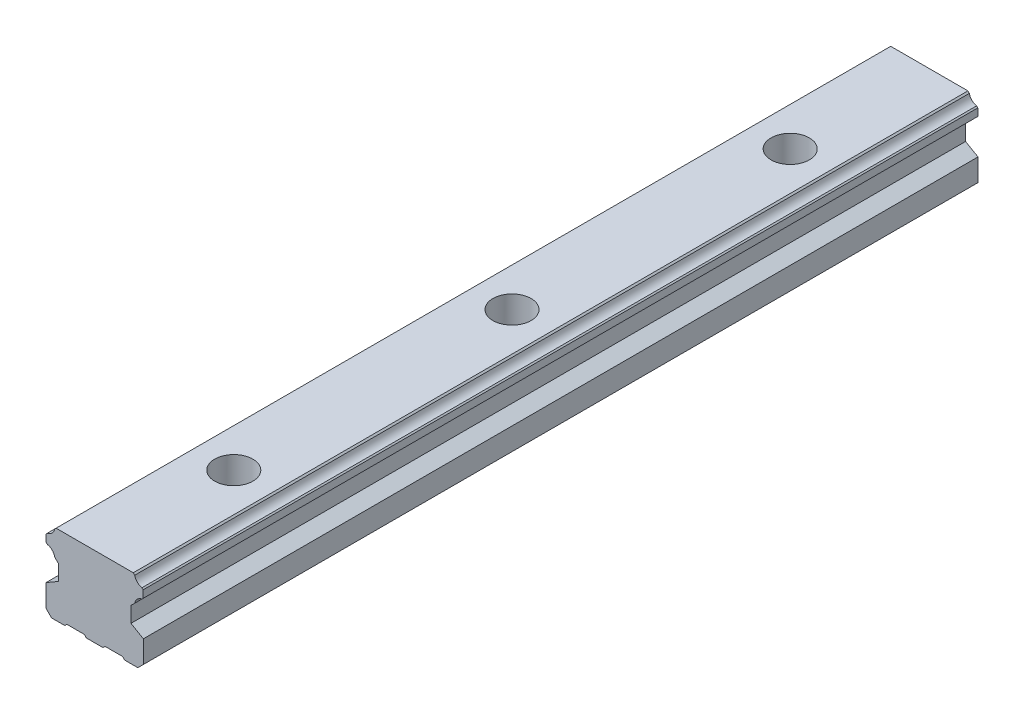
ISO-10303-21;
HEADER;
FILE_DESCRIPTION(('STEP AP214'),'2;1');
FILE_NAME('part.step','',(''),(''),'','','');
FILE_SCHEMA(('AUTOMOTIVE_DESIGN { 1 0 10303 214 1 1 1 1 }'));
ENDSEC;
DATA;
#1=APPLICATION_CONTEXT('core data for automotive mechanical design processes');
#2=APPLICATION_PROTOCOL_DEFINITION('international standard','automotive_design',2000,#1);
#3=PRODUCT_CONTEXT('',#1,'mechanical');
#4=PRODUCT('Part','Part','',(#3));
#5=PRODUCT_RELATED_PRODUCT_CATEGORY('part','',(#4));
#6=PRODUCT_DEFINITION_FORMATION('','',#4);
#7=PRODUCT_DEFINITION_CONTEXT('part definition',#1,'design');
#8=PRODUCT_DEFINITION('design','',#6,#7);
#9=PRODUCT_DEFINITION_SHAPE('','',#8);
#10=(LENGTH_UNIT() NAMED_UNIT(*) SI_UNIT(.MILLI.,.METRE.));
#11=(NAMED_UNIT(*) PLANE_ANGLE_UNIT() SI_UNIT($,.RADIAN.));
#12=(NAMED_UNIT(*) SI_UNIT($,.STERADIAN.) SOLID_ANGLE_UNIT());
#13=UNCERTAINTY_MEASURE_WITH_UNIT(LENGTH_MEASURE(1.E-05),#10,'distance_accuracy_value','');
#14=(GEOMETRIC_REPRESENTATION_CONTEXT(3) GLOBAL_UNCERTAINTY_ASSIGNED_CONTEXT((#13)) GLOBAL_UNIT_ASSIGNED_CONTEXT((#10,
#11,#12)) REPRESENTATION_CONTEXT('',''));
#15=CARTESIAN_POINT('',(0.,0.,0.));
#16=DIRECTION('',(0.,0.,1.));
#17=DIRECTION('',(1.,0.,0.));
#18=AXIS2_PLACEMENT_3D('',#15,#16,#17);
#19=CARTESIAN_POINT('',(-3.00000000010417,-41.3999999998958,-240.));
#20=DIRECTION('',(-0.707106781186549,-0.707106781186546,0.));
#21=DIRECTION('',(0.707106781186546,-0.707106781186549,0.));
#22=AXIS2_PLACEMENT_3D('',#19,#20,#21);
#23=PLANE('',#22);
#24=DIRECTION('',(5.23117659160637E-11,-5.23118726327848E-11,1.));
#25=VECTOR('',#24,1.);
#26=CARTESIAN_POINT('',(-2.4,-42.,-240.));
#27=LINE('',#26,#25);
#28=CARTESIAN_POINT('',(-2.4,-42.,-240.));
#29=VERTEX_POINT('',#28);
#30=CARTESIAN_POINT('',(-2.3999999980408,-42.0000000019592,-202.547547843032));
#31=VERTEX_POINT('',#30);
#32=EDGE_CURVE('E313',#29,#31,#27,.T.);
#33=ORIENTED_EDGE('',*,*,#32,.T.);
#34=CARTESIAN_POINT('',(-2.3999999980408,-42.0000000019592,-202.547547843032));
#35=CARTESIAN_POINT('',(-2.62695710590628,-41.7730428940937,-202.333735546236));
#36=CARTESIAN_POINT('',(-2.8298216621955,-41.5701783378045,-202.085969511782));
#37=CARTESIAN_POINT('',(-3.00000000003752,-41.3999999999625,-201.80277563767));
#38=B_SPLINE_CURVE_WITH_KNOTS('',3,(#34,#35,#36,#37),.UNSPECIFIED.,.F.,.F.,(4,4),(0.,1.),.UNSPECIFIED.);
#39=CARTESIAN_POINT('',(-3.00000000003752,-41.3999999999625,-201.80277563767));
#40=VERTEX_POINT('',#39);
#41=EDGE_CURVE('E300',#31,#40,#38,.T.);
#42=ORIENTED_EDGE('',*,*,#41,.T.);
#43=DIRECTION('',(9.82264174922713E-13,-9.82182791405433E-13,-1.));
#44=VECTOR('',#43,1.);
#45=CARTESIAN_POINT('',(-3.00000000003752,-41.3999999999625,-201.80277563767));
#46=LINE('',#45,#44);
#47=CARTESIAN_POINT('',(-3.,-41.4,-240.));
#48=VERTEX_POINT('',#47);
#49=EDGE_CURVE('E312',#48,#40,#46,.F.);
#50=ORIENTED_EDGE('',*,*,#49,.F.);
#51=DIRECTION('',(0.707106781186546,-0.707106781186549,0.));
#52=VECTOR('',#51,1.);
#53=CARTESIAN_POINT('',(-3.,-41.4,-240.));
#54=LINE('',#53,#52);
#55=EDGE_CURVE('E326',#48,#29,#54,.T.);
#56=ORIENTED_EDGE('',*,*,#55,.T.);
#57=EDGE_LOOP('',(#33,#42,#50,#56));
#58=FACE_BOUND('',#57,.T.);
#59=ADVANCED_FACE('F16',(#58),#23,.T.);
#60=CARTESIAN_POINT('',(-3.,-41.4,-198.197224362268));
#61=DIRECTION('',(-0.707106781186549,-0.707106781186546,0.));
#62=DIRECTION('',(0.707106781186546,-0.707106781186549,0.));
#63=AXIS2_PLACEMENT_3D('',#60,#61,#62);
#64=PLANE('',#63);
#65=DIRECTION('',(-8.16735913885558E-13,8.16718474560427E-13,-1.));
#66=VECTOR('',#65,1.);
#67=CARTESIAN_POINT('',(-2.99999999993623,-41.4000000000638,-121.802775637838));
#68=LINE('',#67,#66);
#69=CARTESIAN_POINT('',(-2.99999999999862,-41.4000000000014,-198.19722436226));
#70=VERTEX_POINT('',#69);
#71=CARTESIAN_POINT('',(-2.99999999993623,-41.4000000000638,-121.802775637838));
#72=VERTEX_POINT('',#71);
#73=EDGE_CURVE('E1124',#70,#72,#68,.F.);
#74=ORIENTED_EDGE('',*,*,#73,.F.);
#75=CARTESIAN_POINT('',(-2.99999999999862,-41.4000000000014,-198.19722436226));
#76=CARTESIAN_POINT('',(-2.82980497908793,-41.5701950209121,-197.914002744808));
#77=CARTESIAN_POINT('',(-2.62694061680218,-41.7730593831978,-197.666248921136));
#78=CARTESIAN_POINT('',(-2.39999999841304,-42.000000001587,-197.452452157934));
#79=B_SPLINE_CURVE_WITH_KNOTS('',3,(#75,#76,#77,#78),.UNSPECIFIED.,.F.,.F.,(4,4),(0.,1.),.UNSPECIFIED.);
#80=CARTESIAN_POINT('',(-2.39999999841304,-42.000000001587,-197.452452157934));
#81=VERTEX_POINT('',#80);
#82=EDGE_CURVE('E1112',#70,#81,#79,.T.);
#83=ORIENTED_EDGE('',*,*,#82,.T.);
#84=DIRECTION('',(5.0874113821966E-12,-5.08739952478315E-12,1.));
#85=VECTOR('',#84,1.);
#86=CARTESIAN_POINT('',(-2.39999999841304,-42.000000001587,-197.452452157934));
#87=LINE('',#86,#85);
#88=CARTESIAN_POINT('',(-2.39999999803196,-42.000000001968,-122.547547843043));
#89=VERTEX_POINT('',#88);
#90=EDGE_CURVE('E1123',#81,#89,#87,.T.);
#91=ORIENTED_EDGE('',*,*,#90,.T.);
#92=CARTESIAN_POINT('',(-2.39999999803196,-42.000000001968,-122.547547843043));
#93=CARTESIAN_POINT('',(-2.62694029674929,-41.7730597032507,-122.333751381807));
#94=CARTESIAN_POINT('',(-2.82980465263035,-41.5701953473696,-122.085997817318));
#95=CARTESIAN_POINT('',(-2.99999999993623,-41.4000000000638,-121.802775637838));
#96=B_SPLINE_CURVE_WITH_KNOTS('',3,(#92,#93,#94,#95),.UNSPECIFIED.,.F.,.F.,(4,4),(0.,1.),.UNSPECIFIED.);
#97=EDGE_CURVE('E374',#89,#72,#96,.T.);
#98=ORIENTED_EDGE('',*,*,#97,.T.);
#99=EDGE_LOOP('',(#74,#83,#91,#98));
#100=FACE_BOUND('',#99,.T.);
#101=ADVANCED_FACE('F344',(#100),#64,.T.);
#102=CARTESIAN_POINT('',(2.39999998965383,-42.0000000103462,-198.197224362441));
#103=DIRECTION('',(0.707106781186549,-0.707106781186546,0.));
#104=DIRECTION('',(0.707106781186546,0.707106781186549,0.));
#105=AXIS2_PLACEMENT_3D('',#102,#103,#104);
#106=PLANE('',#105);
#107=DIRECTION('',(-4.96772857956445E-12,-4.96768707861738E-12,-1.));
#108=VECTOR('',#107,1.);
#109=CARTESIAN_POINT('',(2.39999999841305,-42.000000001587,-122.547547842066));
#110=LINE('',#109,#108);
#111=CARTESIAN_POINT('',(2.39999999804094,-42.0000000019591,-197.452452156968));
#112=VERTEX_POINT('',#111);
#113=CARTESIAN_POINT('',(2.39999999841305,-42.000000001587,-122.547547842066));
#114=VERTEX_POINT('',#113);
#115=EDGE_CURVE('E365',#112,#114,#110,.F.);
#116=ORIENTED_EDGE('',*,*,#115,.F.);
#117=CARTESIAN_POINT('',(2.39999999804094,-42.0000000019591,-197.452452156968));
#118=CARTESIAN_POINT('',(2.62694029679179,-41.7730597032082,-197.666248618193));
#119=CARTESIAN_POINT('',(2.82980465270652,-41.5701953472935,-197.914002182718));
#120=CARTESIAN_POINT('',(3.00000000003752,-41.3999999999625,-198.19722436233));
#121=B_SPLINE_CURVE_WITH_KNOTS('',3,(#117,#118,#119,#120),.UNSPECIFIED.,.F.,.F.,(4,4),(0.,1.),.UNSPECIFIED.);
#122=CARTESIAN_POINT('',(3.00000000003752,-41.3999999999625,-198.19722436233));
#123=VERTEX_POINT('',#122);
#124=EDGE_CURVE('E373',#112,#123,#121,.T.);
#125=ORIENTED_EDGE('',*,*,#124,.T.);
#126=DIRECTION('',(-5.09216667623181E-13,-5.09228293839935E-13,1.));
#127=VECTOR('',#126,1.);
#128=CARTESIAN_POINT('',(3.00000000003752,-41.3999999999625,-198.19722436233));
#129=LINE('',#128,#127);
#130=CARTESIAN_POINT('',(2.99999999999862,-41.4000000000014,-121.80277563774));
#131=VERTEX_POINT('',#130);
#132=EDGE_CURVE('E386',#123,#131,#129,.T.);
#133=ORIENTED_EDGE('',*,*,#132,.T.);
#134=CARTESIAN_POINT('',(2.99999999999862,-41.4000000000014,-121.80277563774));
#135=CARTESIAN_POINT('',(2.82980497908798,-41.570195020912,-122.085997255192));
#136=CARTESIAN_POINT('',(2.62694061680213,-41.7730593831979,-122.333751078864));
#137=CARTESIAN_POINT('',(2.39999999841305,-42.000000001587,-122.547547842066));
#138=B_SPLINE_CURVE_WITH_KNOTS('',3,(#134,#135,#136,#137),.UNSPECIFIED.,.F.,.F.,(4,4),(0.,1.),.UNSPECIFIED.);
#139=EDGE_CURVE('E393',#131,#114,#138,.T.);
#140=ORIENTED_EDGE('',*,*,#139,.T.);
#141=EDGE_LOOP('',(#116,#125,#133,#140));
#142=FACE_BOUND('',#141,.T.);
#143=ADVANCED_FACE('F348',(#142),#106,.T.);
#144=CARTESIAN_POINT('',(2.39999999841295,-42.000000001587,-240.));
#145=DIRECTION('',(0.707106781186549,-0.707106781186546,0.));
#146=DIRECTION('',(0.707106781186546,0.707106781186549,0.));
#147=AXIS2_PLACEMENT_3D('',#144,#145,#146);
#148=PLANE('',#147);
#149=DIRECTION('',(0.,0.,1.));
#150=VECTOR('',#149,1.);
#151=CARTESIAN_POINT('',(3.,-41.4,-240.));
#152=LINE('',#151,#150);
#153=CARTESIAN_POINT('',(3.,-41.4,-240.));
#154=VERTEX_POINT('',#153);
#155=CARTESIAN_POINT('',(2.99999999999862,-41.4000000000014,-201.80277563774));
#156=VERTEX_POINT('',#155);
#157=EDGE_CURVE('E401',#154,#156,#152,.T.);
#158=ORIENTED_EDGE('',*,*,#157,.T.);
#159=CARTESIAN_POINT('',(2.99999999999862,-41.4000000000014,-201.80277563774));
#160=CARTESIAN_POINT('',(2.82982198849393,-41.5701780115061,-202.085968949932));
#161=CARTESIAN_POINT('',(2.6269574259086,-41.7730425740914,-202.3337352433));
#162=CARTESIAN_POINT('',(2.39999999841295,-42.000000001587,-202.547547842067));
#163=B_SPLINE_CURVE_WITH_KNOTS('',3,(#159,#160,#161,#162),.UNSPECIFIED.,.F.,.F.,(4,4),(0.,1.),.UNSPECIFIED.);
#164=CARTESIAN_POINT('',(2.39999999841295,-42.000000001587,-202.547547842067));
#165=VERTEX_POINT('',#164);
#166=EDGE_CURVE('E409',#156,#165,#163,.T.);
#167=ORIENTED_EDGE('',*,*,#166,.T.);
#168=DIRECTION('',(4.23749451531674E-11,4.23749807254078E-11,-1.));
#169=VECTOR('',#168,1.);
#170=CARTESIAN_POINT('',(2.39999999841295,-42.000000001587,-202.547547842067));
#171=LINE('',#170,#169);
#172=CARTESIAN_POINT('',(2.4,-42.,-240.));
#173=VERTEX_POINT('',#172);
#174=EDGE_CURVE('E321',#173,#165,#171,.F.);
#175=ORIENTED_EDGE('',*,*,#174,.F.);
#176=DIRECTION('',(0.707106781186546,0.707106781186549,0.));
#177=VECTOR('',#176,1.);
#178=CARTESIAN_POINT('',(2.4,-42.,-240.));
#179=LINE('',#178,#177);
#180=EDGE_CURVE('E1078',#173,#154,#179,.T.);
#181=ORIENTED_EDGE('',*,*,#180,.T.);
#182=EDGE_LOOP('',(#158,#167,#175,#181));
#183=FACE_BOUND('',#182,.T.);
#184=ADVANCED_FACE('F418',(#183),#148,.T.);
#185=CARTESIAN_POINT('',(-2.4,-42.,-122.547547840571));
#186=DIRECTION('',(0.,-1.,0.));
#187=DIRECTION('',(0.,0.,-1.));
#188=AXIS2_PLACEMENT_3D('',#185,#186,#187);
#189=PLANE('',#188);
#190=ORIENTED_EDGE('',*,*,#90,.F.);
#191=CARTESIAN_POINT('',(0.,-42.,-200.));
#192=DIRECTION('',(0.,1.,0.));
#193=DIRECTION('',(0.,0.,1.));
#194=AXIS2_PLACEMENT_3D('',#191,#192,#193);
#195=CIRCLE('',#194,3.5);
#196=EDGE_CURVE('E1068',#112,#81,#195,.F.);
#197=ORIENTED_EDGE('',*,*,#196,.F.);
#198=ORIENTED_EDGE('',*,*,#115,.T.);
#199=CARTESIAN_POINT('',(0.,-42.,-120.));
#200=DIRECTION('',(0.,1.,0.));
#201=DIRECTION('',(0.,0.,-1.));
#202=AXIS2_PLACEMENT_3D('',#199,#200,#201);
#203=CIRCLE('',#202,3.5);
#204=EDGE_CURVE('E1065',#89,#114,#203,.F.);
#205=ORIENTED_EDGE('',*,*,#204,.F.);
#206=EDGE_LOOP('',(#190,#197,#198,#205));
#207=FACE_BOUND('',#206,.T.);
#208=ADVANCED_FACE('F427',(#207),#189,.T.);
#209=CARTESIAN_POINT('',(-3.,-41.4,-118.197224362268));
#210=DIRECTION('',(-0.707106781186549,-0.707106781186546,0.));
#211=DIRECTION('',(0.707106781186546,-0.707106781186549,0.));
#212=AXIS2_PLACEMENT_3D('',#209,#210,#211);
#213=PLANE('',#212);
#214=DIRECTION('',(-5.73963068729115E-13,5.73963068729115E-13,-1.));
#215=VECTOR('',#214,1.);
#216=CARTESIAN_POINT('',(-2.99999999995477,-41.4000000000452,-41.8027756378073));
#217=LINE('',#216,#215);
#218=CARTESIAN_POINT('',(-2.99999999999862,-41.4000000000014,-118.19722436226));
#219=VERTEX_POINT('',#218);
#220=CARTESIAN_POINT('',(-2.99999999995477,-41.4000000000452,-41.8027756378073));
#221=VERTEX_POINT('',#220);
#222=EDGE_CURVE('E1063',#219,#221,#217,.F.);
#223=ORIENTED_EDGE('',*,*,#222,.F.);
#224=CARTESIAN_POINT('',(-2.99999999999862,-41.4000000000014,-118.19722436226));
#225=CARTESIAN_POINT('',(-2.82980497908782,-41.5701950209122,-117.914002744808));
#226=CARTESIAN_POINT('',(-2.62694061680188,-41.7730593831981,-117.666248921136));
#227=CARTESIAN_POINT('',(-2.39999999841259,-42.0000000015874,-117.452452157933));
#228=B_SPLINE_CURVE_WITH_KNOTS('',3,(#224,#225,#226,#227),.UNSPECIFIED.,.F.,.F.,(4,4),(0.,1.),.UNSPECIFIED.);
#229=CARTESIAN_POINT('',(-2.39999999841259,-42.0000000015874,-117.452452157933));
#230=VERTEX_POINT('',#229);
#231=EDGE_CURVE('E1062',#219,#230,#228,.T.);
#232=ORIENTED_EDGE('',*,*,#231,.T.);
#233=DIRECTION('',(5.0720619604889E-12,-5.07212717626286E-12,1.));
#234=VECTOR('',#233,1.);
#235=CARTESIAN_POINT('',(-2.39999999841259,-42.0000000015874,-117.452452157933));
#236=LINE('',#235,#234);
#237=CARTESIAN_POINT('',(-2.39999999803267,-42.0000000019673,-42.5475478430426));
#238=VERTEX_POINT('',#237);
#239=EDGE_CURVE('E1057',#230,#238,#236,.T.);
#240=ORIENTED_EDGE('',*,*,#239,.T.);
#241=CARTESIAN_POINT('',(-2.39999999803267,-42.0000000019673,-42.5475478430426));
#242=CARTESIAN_POINT('',(-2.62694029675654,-41.7730597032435,-42.3337513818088));
#243=CARTESIAN_POINT('',(-2.82980465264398,-41.570195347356,-42.0859978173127));
#244=CARTESIAN_POINT('',(-2.99999999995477,-41.4000000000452,-41.8027756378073));
#245=B_SPLINE_CURVE_WITH_KNOTS('',3,(#241,#242,#243,#244),.UNSPECIFIED.,.F.,.F.,(4,4),(0.,1.),.UNSPECIFIED.);
#246=EDGE_CURVE('E461',#238,#221,#245,.T.);
#247=ORIENTED_EDGE('',*,*,#246,.T.);
#248=EDGE_LOOP('',(#223,#232,#240,#247));
#249=FACE_BOUND('',#248,.T.);
#250=ADVANCED_FACE('F430',(#249),#213,.T.);
#251=CARTESIAN_POINT('',(2.39999998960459,-42.0000000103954,-118.197224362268));
#252=DIRECTION('',(0.707106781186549,-0.707106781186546,0.));
#253=DIRECTION('',(0.707106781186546,0.707106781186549,0.));
#254=AXIS2_PLACEMENT_3D('',#251,#252,#253);
#255=PLANE('',#254);
#256=DIRECTION('',(-5.09205355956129E-12,-5.09204763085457E-12,-1.));
#257=VECTOR('',#256,1.);
#258=CARTESIAN_POINT('',(2.39999999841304,-42.000000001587,-42.5475478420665));
#259=LINE('',#258,#257);
#260=CARTESIAN_POINT('',(2.39999999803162,-42.0000000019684,-117.452452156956));
#261=VERTEX_POINT('',#260);
#262=CARTESIAN_POINT('',(2.39999999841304,-42.000000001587,-42.5475478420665));
#263=VERTEX_POINT('',#262);
#264=EDGE_CURVE('E452',#261,#263,#259,.F.);
#265=ORIENTED_EDGE('',*,*,#264,.F.);
#266=CARTESIAN_POINT('',(2.39999999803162,-42.0000000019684,-117.452452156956));
#267=CARTESIAN_POINT('',(2.62694029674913,-41.7730597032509,-117.666248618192));
#268=CARTESIAN_POINT('',(2.82980465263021,-41.5701953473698,-117.914002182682));
#269=CARTESIAN_POINT('',(2.99999999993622,-41.4000000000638,-118.197224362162));
#270=B_SPLINE_CURVE_WITH_KNOTS('',3,(#266,#267,#268,#269),.UNSPECIFIED.,.F.,.F.,(4,4),(0.,1.),.UNSPECIFIED.);
#271=CARTESIAN_POINT('',(2.99999999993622,-41.4000000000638,-118.197224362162));
#272=VERTEX_POINT('',#271);
#273=EDGE_CURVE('E460',#261,#272,#270,.T.);
#274=ORIENTED_EDGE('',*,*,#273,.T.);
#275=DIRECTION('',(8.16805671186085E-13,8.16811484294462E-13,1.));
#276=VECTOR('',#275,1.);
#277=CARTESIAN_POINT('',(2.99999999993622,-41.4000000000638,-118.197224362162));
#278=LINE('',#277,#276);
#279=CARTESIAN_POINT('',(2.99999999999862,-41.4000000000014,-41.8027756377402));
#280=VERTEX_POINT('',#279);
#281=EDGE_CURVE('E473',#272,#280,#278,.T.);
#282=ORIENTED_EDGE('',*,*,#281,.T.);
#283=CARTESIAN_POINT('',(2.99999999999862,-41.4000000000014,-41.8027756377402));
#284=CARTESIAN_POINT('',(2.82980497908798,-41.570195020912,-42.0859972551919));
#285=CARTESIAN_POINT('',(2.62694061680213,-41.7730593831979,-42.3337510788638));
#286=CARTESIAN_POINT('',(2.39999999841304,-42.000000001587,-42.5475478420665));
#287=B_SPLINE_CURVE_WITH_KNOTS('',3,(#283,#284,#285,#286),.UNSPECIFIED.,.F.,.F.,(4,4),(0.,1.),.UNSPECIFIED.);
#288=EDGE_CURVE('E480',#280,#263,#287,.T.);
#289=ORIENTED_EDGE('',*,*,#288,.T.);
#290=EDGE_LOOP('',(#265,#274,#282,#289));
#291=FACE_BOUND('',#290,.T.);
#292=ADVANCED_FACE('F435',(#291),#255,.T.);
#293=CARTESIAN_POINT('',(-2.4,-42.,-42.5475478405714));
#294=DIRECTION('',(0.,-1.,0.));
#295=DIRECTION('',(0.,0.,-1.));
#296=AXIS2_PLACEMENT_3D('',#293,#294,#295);
#297=PLANE('',#296);
#298=ORIENTED_EDGE('',*,*,#239,.F.);
#299=CARTESIAN_POINT('',(0.,-42.,-120.));
#300=DIRECTION('',(0.,1.,0.));
#301=DIRECTION('',(0.,0.,1.));
#302=AXIS2_PLACEMENT_3D('',#299,#300,#301);
#303=CIRCLE('',#302,3.5);
#304=EDGE_CURVE('E488',#261,#230,#303,.F.);
#305=ORIENTED_EDGE('',*,*,#304,.F.);
#306=ORIENTED_EDGE('',*,*,#264,.T.);
#307=CARTESIAN_POINT('',(0.,-42.,-40.));
#308=DIRECTION('',(0.,1.,0.));
#309=DIRECTION('',(0.,0.,-1.));
#310=AXIS2_PLACEMENT_3D('',#307,#308,#309);
#311=CIRCLE('',#310,3.5);
#312=EDGE_CURVE('E495',#238,#263,#311,.F.);
#313=ORIENTED_EDGE('',*,*,#312,.F.);
#314=EDGE_LOOP('',(#298,#305,#306,#313));
#315=FACE_BOUND('',#314,.T.);
#316=ADVANCED_FACE('F529',(#315),#297,.T.);
#317=CARTESIAN_POINT('',(-3.,-41.4,-38.1972243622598));
#318=DIRECTION('',(-0.707106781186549,-0.707106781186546,0.));
#319=DIRECTION('',(0.707106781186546,-0.707106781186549,0.));
#320=AXIS2_PLACEMENT_3D('',#317,#318,#319);
#321=PLANE('',#320);
#322=DIRECTION('',(0.,0.,-1.));
#323=VECTOR('',#322,1.);
#324=CARTESIAN_POINT('',(-3.,-41.4,0.));
#325=LINE('',#324,#323);
#326=CARTESIAN_POINT('',(-2.99999999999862,-41.4000000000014,-38.1972243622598));
#327=VERTEX_POINT('',#326);
#328=CARTESIAN_POINT('',(-3.,-41.4,0.));
#329=VERTEX_POINT('',#328);
#330=EDGE_CURVE('E499',#327,#329,#325,.F.);
#331=ORIENTED_EDGE('',*,*,#330,.F.);
#332=CARTESIAN_POINT('',(-2.99999999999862,-41.4000000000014,-38.1972243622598));
#333=CARTESIAN_POINT('',(-2.82982198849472,-41.5701780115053,-37.9140310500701));
#334=CARTESIAN_POINT('',(-2.62695742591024,-41.7730425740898,-37.6662647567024));
#335=CARTESIAN_POINT('',(-2.39999999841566,-42.0000000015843,-37.452452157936));
#336=B_SPLINE_CURVE_WITH_KNOTS('',3,(#332,#333,#334,#335),.UNSPECIFIED.,.F.,.F.,(4,4),(0.,1.),.UNSPECIFIED.);
#337=CARTESIAN_POINT('',(-2.39999999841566,-42.0000000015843,-37.452452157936));
#338=VERTEX_POINT('',#337);
#339=EDGE_CURVE('E504',#327,#338,#336,.T.);
#340=ORIENTED_EDGE('',*,*,#339,.T.);
#341=DIRECTION('',(-4.23026979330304E-11,4.23026979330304E-11,1.));
#342=VECTOR('',#341,1.);
#343=CARTESIAN_POINT('',(-2.39999999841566,-42.0000000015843,-37.452452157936));
#344=LINE('',#343,#342);
#345=CARTESIAN_POINT('',(-2.4,-42.,0.));
#346=VERTEX_POINT('',#345);
#347=EDGE_CURVE('E517',#338,#346,#344,.T.);
#348=ORIENTED_EDGE('',*,*,#347,.T.);
#349=DIRECTION('',(-0.707106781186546,0.707106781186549,0.));
#350=VECTOR('',#349,1.);
#351=CARTESIAN_POINT('',(-2.4,-42.,0.));
#352=LINE('',#351,#350);
#353=EDGE_CURVE('E1644',#329,#346,#352,.F.);
#354=ORIENTED_EDGE('',*,*,#353,.F.);
#355=EDGE_LOOP('',(#331,#340,#348,#354));
#356=FACE_BOUND('',#355,.T.);
#357=ADVANCED_FACE('F519',(#356),#321,.T.);
#358=CARTESIAN_POINT('',(-2.4,-42.,0.));
#359=DIRECTION('',(0.,-1.,0.));
#360=DIRECTION('',(0.,0.,-1.));
#361=AXIS2_PLACEMENT_3D('',#358,#359,#360);
#362=PLANE('',#361);
#363=ORIENTED_EDGE('',*,*,#347,.F.);
#364=CARTESIAN_POINT('',(0.,-42.,-40.));
#365=DIRECTION('',(0.,1.,0.));
#366=DIRECTION('',(0.,0.,1.));
#367=AXIS2_PLACEMENT_3D('',#364,#365,#366);
#368=CIRCLE('',#367,3.5);
#369=CARTESIAN_POINT('',(2.39999999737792,-42.,-37.4524521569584));
#370=VERTEX_POINT('',#369);
#371=EDGE_CURVE('E1635',#370,#338,#368,.F.);
#372=ORIENTED_EDGE('',*,*,#371,.F.);
#373=DIRECTION('',(7.00110068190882E-11,0.,1.));
#374=VECTOR('',#373,1.);
#375=CARTESIAN_POINT('',(2.39999999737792,-42.,-37.4524521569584));
#376=LINE('',#375,#374);
#377=CARTESIAN_POINT('',(2.4,-42.,0.));
#378=VERTEX_POINT('',#377);
#379=EDGE_CURVE('E1631',#370,#378,#376,.T.);
#380=ORIENTED_EDGE('',*,*,#379,.T.);
#381=DIRECTION('',(-1.,0.,0.));
#382=VECTOR('',#381,1.);
#383=CARTESIAN_POINT('',(2.4,-42.,0.));
#384=LINE('',#383,#382);
#385=EDGE_CURVE('E1632',#346,#378,#384,.F.);
#386=ORIENTED_EDGE('',*,*,#385,.F.);
#387=EDGE_LOOP('',(#363,#372,#380,#386));
#388=FACE_BOUND('',#387,.T.);
#389=ADVANCED_FACE('F528',(#388),#362,.T.);
#390=CARTESIAN_POINT('',(2.39999999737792,-42.0000000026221,-38.1972243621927));
#391=DIRECTION('',(0.707106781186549,-0.707106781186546,0.));
#392=DIRECTION('',(0.707106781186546,0.707106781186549,0.));
#393=AXIS2_PLACEMENT_3D('',#390,#391,#392);
#394=PLANE('',#393);
#395=ORIENTED_EDGE('',*,*,#379,.F.);
#396=CARTESIAN_POINT('',(2.39999999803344,-42.0000000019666,-37.4524521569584));
#397=CARTESIAN_POINT('',(2.62695710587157,-41.7730428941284,-37.6662644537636));
#398=CARTESIAN_POINT('',(2.82982166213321,-41.5701783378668,-37.9140304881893));
#399=CARTESIAN_POINT('',(2.99999999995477,-41.4000000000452,-38.1972243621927));
#400=B_SPLINE_CURVE_WITH_KNOTS('',3,(#396,#397,#398,#399),.UNSPECIFIED.,.F.,.F.,(4,4),(0.,1.),.UNSPECIFIED.);
#401=CARTESIAN_POINT('',(2.99999999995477,-41.4000000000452,-38.1972243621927));
#402=VERTEX_POINT('',#401);
#403=EDGE_CURVE('E556',#370,#402,#400,.T.);
#404=ORIENTED_EDGE('',*,*,#403,.T.);
#405=DIRECTION('',(1.18401391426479E-12,1.18401391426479E-12,1.));
#406=VECTOR('',#405,1.);
#407=CARTESIAN_POINT('',(2.99999999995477,-41.4000000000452,-38.1972243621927));
#408=LINE('',#407,#406);
#409=CARTESIAN_POINT('',(3.,-41.4,0.));
#410=VERTEX_POINT('',#409);
#411=EDGE_CURVE('E547',#402,#410,#408,.T.);
#412=ORIENTED_EDGE('',*,*,#411,.T.);
#413=DIRECTION('',(-0.707106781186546,-0.707106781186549,0.));
#414=VECTOR('',#413,1.);
#415=CARTESIAN_POINT('',(3.,-41.4,0.));
#416=LINE('',#415,#414);
#417=EDGE_CURVE('E555',#378,#410,#416,.F.);
#418=ORIENTED_EDGE('',*,*,#417,.F.);
#419=EDGE_LOOP('',(#395,#404,#412,#418));
#420=FACE_BOUND('',#419,.T.);
#421=ADVANCED_FACE('F532',(#420),#394,.T.);
#422=CARTESIAN_POINT('',(-14.,-40.4,-240.));
#423=DIRECTION('',(-1.,0.,0.));
#424=DIRECTION('',(0.,0.,1.));
#425=AXIS2_PLACEMENT_3D('',#422,#423,#424);
#426=PLANE('',#425);
#427=DIRECTION('',(0.,1.,0.));
#428=VECTOR('',#427,1.);
#429=CARTESIAN_POINT('',(-14.,-40.4,0.));
#430=LINE('',#429,#428);
#431=CARTESIAN_POINT('',(-14.,-34.,0.));
#432=VERTEX_POINT('',#431);
#433=CARTESIAN_POINT('',(-14.,-40.4,0.));
#434=VERTEX_POINT('',#433);
#435=EDGE_CURVE('E560',#432,#434,#430,.F.);
#436=ORIENTED_EDGE('',*,*,#435,.F.);
#437=DIRECTION('',(0.,0.,-1.));
#438=VECTOR('',#437,1.);
#439=CARTESIAN_POINT('',(-14.,-34.,0.));
#440=LINE('',#439,#438);
#441=CARTESIAN_POINT('',(-14.,-34.,-240.));
#442=VERTEX_POINT('',#441);
#443=EDGE_CURVE('E564',#442,#432,#440,.F.);
#444=ORIENTED_EDGE('',*,*,#443,.F.);
#445=DIRECTION('',(0.,-1.,0.));
#446=VECTOR('',#445,1.);
#447=CARTESIAN_POINT('',(-14.,-34.,-240.));
#448=LINE('',#447,#446);
#449=CARTESIAN_POINT('',(-14.,-40.4,-240.));
#450=VERTEX_POINT('',#449);
#451=EDGE_CURVE('E569',#442,#450,#448,.T.);
#452=ORIENTED_EDGE('',*,*,#451,.T.);
#453=DIRECTION('',(0.,0.,1.));
#454=VECTOR('',#453,1.);
#455=CARTESIAN_POINT('',(-14.,-40.4,-240.));
#456=LINE('',#455,#454);
#457=EDGE_CURVE('E574',#450,#434,#456,.T.);
#458=ORIENTED_EDGE('',*,*,#457,.T.);
#459=EDGE_LOOP('',(#436,#444,#452,#458));
#460=FACE_BOUND('',#459,.T.);
#461=ADVANCED_FACE('F537',(#460),#426,.T.);
#462=CARTESIAN_POINT('',(-14.,-40.4,-240.));
#463=DIRECTION('',(-0.707106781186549,-0.707106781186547,0.));
#464=DIRECTION('',(0.707106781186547,-0.707106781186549,0.));
#465=AXIS2_PLACEMENT_3D('',#462,#463,#464);
#466=PLANE('',#465);
#467=DIRECTION('',(-0.707106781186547,0.707106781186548,0.));
#468=VECTOR('',#467,1.);
#469=CARTESIAN_POINT('',(-12.4,-42.,0.));
#470=LINE('',#469,#468);
#471=CARTESIAN_POINT('',(-12.4,-42.,0.));
#472=VERTEX_POINT('',#471);
#473=EDGE_CURVE('E579',#434,#472,#470,.F.);
#474=ORIENTED_EDGE('',*,*,#473,.F.);
#475=ORIENTED_EDGE('',*,*,#457,.F.);
#476=DIRECTION('',(0.707106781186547,-0.707106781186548,0.));
#477=VECTOR('',#476,1.);
#478=CARTESIAN_POINT('',(-14.,-40.4,-240.));
#479=LINE('',#478,#477);
#480=CARTESIAN_POINT('',(-12.4,-42.,-240.));
#481=VERTEX_POINT('',#480);
#482=EDGE_CURVE('E583',#450,#481,#479,.T.);
#483=ORIENTED_EDGE('',*,*,#482,.T.);
#484=DIRECTION('',(0.,0.,1.));
#485=VECTOR('',#484,1.);
#486=CARTESIAN_POINT('',(-12.4,-42.,-240.));
#487=LINE('',#486,#485);
#488=EDGE_CURVE('E588',#481,#472,#487,.T.);
#489=ORIENTED_EDGE('',*,*,#488,.T.);
#490=EDGE_LOOP('',(#474,#475,#483,#489));
#491=FACE_BOUND('',#490,.T.);
#492=ADVANCED_FACE('F1189',(#491),#466,.T.);
#493=CARTESIAN_POINT('',(-12.4,-42.,0.));
#494=DIRECTION('',(0.,-1.,0.));
#495=DIRECTION('',(0.,0.,-1.));
#496=AXIS2_PLACEMENT_3D('',#493,#494,#495);
#497=PLANE('',#496);
#498=DIRECTION('',(-1.,0.,0.));
#499=VECTOR('',#498,1.);
#500=CARTESIAN_POINT('',(-8.6,-42.,0.));
#501=LINE('',#500,#499);
#502=CARTESIAN_POINT('',(-8.6,-42.,0.));
#503=VERTEX_POINT('',#502);
#504=EDGE_CURVE('E593',#472,#503,#501,.F.);
#505=ORIENTED_EDGE('',*,*,#504,.F.);
#506=ORIENTED_EDGE('',*,*,#488,.F.);
#507=DIRECTION('',(1.,0.,0.));
#508=VECTOR('',#507,1.);
#509=CARTESIAN_POINT('',(-12.4,-42.,-240.));
#510=LINE('',#509,#508);
#511=CARTESIAN_POINT('',(-8.6,-42.,-240.));
#512=VERTEX_POINT('',#511);
#513=EDGE_CURVE('E597',#481,#512,#510,.T.);
#514=ORIENTED_EDGE('',*,*,#513,.T.);
#515=DIRECTION('',(0.,0.,1.));
#516=VECTOR('',#515,1.);
#517=CARTESIAN_POINT('',(-8.6,-42.,-240.));
#518=LINE('',#517,#516);
#519=EDGE_CURVE('E602',#512,#503,#518,.T.);
#520=ORIENTED_EDGE('',*,*,#519,.T.);
#521=EDGE_LOOP('',(#505,#506,#514,#520));
#522=FACE_BOUND('',#521,.T.);
#523=ADVANCED_FACE('F1196',(#522),#497,.T.);
#524=CARTESIAN_POINT('',(-8.6,-42.,-240.));
#525=DIRECTION('',(0.707106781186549,-0.707106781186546,0.));
#526=DIRECTION('',(0.707106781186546,0.707106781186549,0.));
#527=AXIS2_PLACEMENT_3D('',#524,#525,#526);
#528=PLANE('',#527);
#529=DIRECTION('',(-0.707106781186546,-0.707106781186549,0.));
#530=VECTOR('',#529,1.);
#531=CARTESIAN_POINT('',(-8.,-41.4,0.));
#532=LINE('',#531,#530);
#533=CARTESIAN_POINT('',(-8.,-41.4,0.));
#534=VERTEX_POINT('',#533);
#535=EDGE_CURVE('E607',#503,#534,#532,.F.);
#536=ORIENTED_EDGE('',*,*,#535,.F.);
#537=ORIENTED_EDGE('',*,*,#519,.F.);
#538=DIRECTION('',(0.707106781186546,0.707106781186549,0.));
#539=VECTOR('',#538,1.);
#540=CARTESIAN_POINT('',(-8.6,-42.,-240.));
#541=LINE('',#540,#539);
#542=CARTESIAN_POINT('',(-8.,-41.4,-240.));
#543=VERTEX_POINT('',#542);
#544=EDGE_CURVE('E611',#512,#543,#541,.T.);
#545=ORIENTED_EDGE('',*,*,#544,.T.);
#546=DIRECTION('',(0.,0.,1.));
#547=VECTOR('',#546,1.);
#548=CARTESIAN_POINT('',(-8.,-41.4,-240.));
#549=LINE('',#548,#547);
#550=EDGE_CURVE('E616',#543,#534,#549,.T.);
#551=ORIENTED_EDGE('',*,*,#550,.T.);
#552=EDGE_LOOP('',(#536,#537,#545,#551));
#553=FACE_BOUND('',#552,.T.);
#554=ADVANCED_FACE('F1203',(#553),#528,.T.);
#555=CARTESIAN_POINT('',(-8.,-41.4,0.));
#556=DIRECTION('',(0.,-1.,0.));
#557=DIRECTION('',(0.,0.,-1.));
#558=AXIS2_PLACEMENT_3D('',#555,#556,#557);
#559=PLANE('',#558);
#560=ORIENTED_EDGE('',*,*,#49,.T.);
#561=CARTESIAN_POINT('',(0.,-41.4,-200.));
#562=DIRECTION('',(0.,1.,0.));
#563=DIRECTION('',(-0.857142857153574,0.,-0.51507875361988));
#564=AXIS2_PLACEMENT_3D('',#561,#562,#563);
#565=CIRCLE('',#564,3.5);
#566=EDGE_CURVE('E306',#40,#70,#565,.T.);
#567=ORIENTED_EDGE('',*,*,#566,.T.);
#568=ORIENTED_EDGE('',*,*,#73,.T.);
#569=CARTESIAN_POINT('',(0.,-41.4,-120.));
#570=DIRECTION('',(0.,1.,0.));
#571=DIRECTION('',(-0.857142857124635,0.,-0.515078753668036));
#572=AXIS2_PLACEMENT_3D('',#569,#570,#571);
#573=CIRCLE('',#572,3.5);
#574=EDGE_CURVE('E624',#72,#219,#573,.T.);
#575=ORIENTED_EDGE('',*,*,#574,.T.);
#576=ORIENTED_EDGE('',*,*,#222,.T.);
#577=CARTESIAN_POINT('',(0.,-41.4,-40.));
#578=DIRECTION('',(0.,1.,0.));
#579=DIRECTION('',(-0.857142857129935,0.,-0.515078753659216));
#580=AXIS2_PLACEMENT_3D('',#577,#578,#579);
#581=CIRCLE('',#580,3.5);
#582=EDGE_CURVE('E629',#221,#327,#581,.T.);
#583=ORIENTED_EDGE('',*,*,#582,.T.);
#584=ORIENTED_EDGE('',*,*,#330,.T.);
#585=DIRECTION('',(-1.,0.,0.));
#586=VECTOR('',#585,1.);
#587=CARTESIAN_POINT('',(-3.,-41.4,0.));
#588=LINE('',#587,#586);
#589=EDGE_CURVE('E634',#534,#329,#588,.F.);
#590=ORIENTED_EDGE('',*,*,#589,.F.);
#591=ORIENTED_EDGE('',*,*,#550,.F.);
#592=DIRECTION('',(1.,0.,0.));
#593=VECTOR('',#592,1.);
#594=CARTESIAN_POINT('',(-8.,-41.4,-240.));
#595=LINE('',#594,#593);
#596=EDGE_CURVE('E323',#543,#48,#595,.T.);
#597=ORIENTED_EDGE('',*,*,#596,.T.);
#598=EDGE_LOOP('',(#560,#567,#568,#575,#576,#583,#584,#590,#591,#597));
#599=FACE_BOUND('',#598,.T.);
#600=ADVANCED_FACE('F1126',(#599),#559,.T.);
#601=CARTESIAN_POINT('',(-2.4,-42.,-202.547547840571));
#602=DIRECTION('',(0.,-1.,0.));
#603=DIRECTION('',(0.,0.,-1.));
#604=AXIS2_PLACEMENT_3D('',#601,#602,#603);
#605=PLANE('',#604);
#606=ORIENTED_EDGE('',*,*,#174,.T.);
#607=CARTESIAN_POINT('',(0.,-42.,-200.));
#608=DIRECTION('',(0.,1.,0.));
#609=DIRECTION('',(0.,0.,-1.));
#610=AXIS2_PLACEMENT_3D('',#607,#608,#609);
#611=CIRCLE('',#610,3.5);
#612=EDGE_CURVE('E303',#31,#165,#611,.F.);
#613=ORIENTED_EDGE('',*,*,#612,.F.);
#614=ORIENTED_EDGE('',*,*,#32,.F.);
#615=DIRECTION('',(1.,0.,0.));
#616=VECTOR('',#615,1.);
#617=CARTESIAN_POINT('',(-2.4,-42.,-240.));
#618=LINE('',#617,#616);
#619=EDGE_CURVE('E322',#29,#173,#618,.T.);
#620=ORIENTED_EDGE('',*,*,#619,.T.);
#621=EDGE_LOOP('',(#606,#613,#614,#620));
#622=FACE_BOUND('',#621,.T.);
#623=ADVANCED_FACE('F318',(#622),#605,.T.);
#624=CARTESIAN_POINT('',(2.99999999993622,-41.4,0.));
#625=DIRECTION('',(0.,-1.,0.));
#626=DIRECTION('',(0.,0.,-1.));
#627=AXIS2_PLACEMENT_3D('',#624,#625,#626);
#628=PLANE('',#627);
#629=ORIENTED_EDGE('',*,*,#132,.F.);
#630=CARTESIAN_POINT('',(0.,-41.4,-200.));
#631=DIRECTION('',(0.,1.,0.));
#632=DIRECTION('',(0.857142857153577,0.,0.515078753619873));
#633=AXIS2_PLACEMENT_3D('',#630,#631,#632);
#634=CIRCLE('',#633,3.5);
#635=EDGE_CURVE('E647',#123,#156,#634,.T.);
#636=ORIENTED_EDGE('',*,*,#635,.T.);
#637=ORIENTED_EDGE('',*,*,#157,.F.);
#638=DIRECTION('',(1.,0.,0.));
#639=VECTOR('',#638,1.);
#640=CARTESIAN_POINT('',(3.,-41.4,-240.));
#641=LINE('',#640,#639);
#642=CARTESIAN_POINT('',(8.,-41.4,-240.));
#643=VERTEX_POINT('',#642);
#644=EDGE_CURVE('E652',#154,#643,#641,.T.);
#645=ORIENTED_EDGE('',*,*,#644,.T.);
#646=DIRECTION('',(0.,0.,1.));
#647=VECTOR('',#646,1.);
#648=CARTESIAN_POINT('',(8.,-41.4,-240.));
#649=LINE('',#648,#647);
#650=CARTESIAN_POINT('',(8.,-41.4,0.));
#651=VERTEX_POINT('',#650);
#652=EDGE_CURVE('E657',#643,#651,#649,.T.);
#653=ORIENTED_EDGE('',*,*,#652,.T.);
#654=DIRECTION('',(-1.,0.,0.));
#655=VECTOR('',#654,1.);
#656=CARTESIAN_POINT('',(8.,-41.4,0.));
#657=LINE('',#656,#655);
#658=EDGE_CURVE('E662',#410,#651,#657,.F.);
#659=ORIENTED_EDGE('',*,*,#658,.F.);
#660=ORIENTED_EDGE('',*,*,#411,.F.);
#661=CARTESIAN_POINT('',(0.,-41.4,-40.));
#662=DIRECTION('',(0.,1.,0.));
#663=DIRECTION('',(0.857142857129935,0.,0.515078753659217));
#664=AXIS2_PLACEMENT_3D('',#661,#662,#663);
#665=CIRCLE('',#664,3.5);
#666=EDGE_CURVE('E666',#402,#280,#665,.T.);
#667=ORIENTED_EDGE('',*,*,#666,.T.);
#668=ORIENTED_EDGE('',*,*,#281,.F.);
#669=CARTESIAN_POINT('',(0.,-41.4,-120.));
#670=DIRECTION('',(0.,1.,0.));
#671=DIRECTION('',(0.857142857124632,0.,0.515078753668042));
#672=AXIS2_PLACEMENT_3D('',#669,#670,#671);
#673=CIRCLE('',#672,3.5);
#674=EDGE_CURVE('E671',#272,#131,#673,.T.);
#675=ORIENTED_EDGE('',*,*,#674,.T.);
#676=EDGE_LOOP('',(#629,#636,#637,#645,#653,#659,#660,#667,#668,#675));
#677=FACE_BOUND('',#676,.T.);
#678=ADVANCED_FACE('F1085',(#677),#628,.T.);
#679=CARTESIAN_POINT('',(8.,-41.4,-240.));
#680=DIRECTION('',(-0.707106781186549,-0.707106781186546,0.));
#681=DIRECTION('',(0.707106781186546,-0.707106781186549,0.));
#682=AXIS2_PLACEMENT_3D('',#679,#680,#681);
#683=PLANE('',#682);
#684=DIRECTION('',(-0.707106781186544,0.707106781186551,0.));
#685=VECTOR('',#684,1.);
#686=CARTESIAN_POINT('',(8.6,-42.,0.));
#687=LINE('',#686,#685);
#688=CARTESIAN_POINT('',(8.6,-42.,0.));
#689=VERTEX_POINT('',#688);
#690=EDGE_CURVE('E676',#651,#689,#687,.F.);
#691=ORIENTED_EDGE('',*,*,#690,.F.);
#692=ORIENTED_EDGE('',*,*,#652,.F.);
#693=DIRECTION('',(0.707106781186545,-0.70710678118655,0.));
#694=VECTOR('',#693,1.);
#695=CARTESIAN_POINT('',(8.,-41.4,-240.));
#696=LINE('',#695,#694);
#697=CARTESIAN_POINT('',(8.6,-42.,-240.));
#698=VERTEX_POINT('',#697);
#699=EDGE_CURVE('E680',#643,#698,#696,.T.);
#700=ORIENTED_EDGE('',*,*,#699,.T.);
#701=DIRECTION('',(0.,0.,1.));
#702=VECTOR('',#701,1.);
#703=CARTESIAN_POINT('',(8.6,-42.,-240.));
#704=LINE('',#703,#702);
#705=EDGE_CURVE('E685',#698,#689,#704,.T.);
#706=ORIENTED_EDGE('',*,*,#705,.T.);
#707=EDGE_LOOP('',(#691,#692,#700,#706));
#708=FACE_BOUND('',#707,.T.);
#709=ADVANCED_FACE('F1230',(#708),#683,.T.);
#710=CARTESIAN_POINT('',(8.6,-42.,0.));
#711=DIRECTION('',(0.,-1.,0.));
#712=DIRECTION('',(0.,0.,-1.));
#713=AXIS2_PLACEMENT_3D('',#710,#711,#712);
#714=PLANE('',#713);
#715=DIRECTION('',(-1.,0.,0.));
#716=VECTOR('',#715,1.);
#717=CARTESIAN_POINT('',(12.4,-42.,0.));
#718=LINE('',#717,#716);
#719=CARTESIAN_POINT('',(12.4,-42.,0.));
#720=VERTEX_POINT('',#719);
#721=EDGE_CURVE('E690',#689,#720,#718,.F.);
#722=ORIENTED_EDGE('',*,*,#721,.F.);
#723=ORIENTED_EDGE('',*,*,#705,.F.);
#724=DIRECTION('',(1.,0.,0.));
#725=VECTOR('',#724,1.);
#726=CARTESIAN_POINT('',(8.6,-42.,-240.));
#727=LINE('',#726,#725);
#728=CARTESIAN_POINT('',(12.4,-42.,-240.));
#729=VERTEX_POINT('',#728);
#730=EDGE_CURVE('E694',#698,#729,#727,.T.);
#731=ORIENTED_EDGE('',*,*,#730,.T.);
#732=DIRECTION('',(0.,0.,1.));
#733=VECTOR('',#732,1.);
#734=CARTESIAN_POINT('',(12.4,-42.,-240.));
#735=LINE('',#734,#733);
#736=EDGE_CURVE('E699',#729,#720,#735,.T.);
#737=ORIENTED_EDGE('',*,*,#736,.T.);
#738=EDGE_LOOP('',(#722,#723,#731,#737));
#739=FACE_BOUND('',#738,.T.);
#740=ADVANCED_FACE('F1237',(#739),#714,.T.);
#741=CARTESIAN_POINT('',(12.4,-42.,-240.));
#742=DIRECTION('',(0.707106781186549,-0.707106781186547,0.));
#743=DIRECTION('',(0.707106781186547,0.707106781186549,0.));
#744=AXIS2_PLACEMENT_3D('',#741,#742,#743);
#745=PLANE('',#744);
#746=DIRECTION('',(-0.707106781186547,-0.707106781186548,0.));
#747=VECTOR('',#746,1.);
#748=CARTESIAN_POINT('',(14.,-40.4,0.));
#749=LINE('',#748,#747);
#750=CARTESIAN_POINT('',(14.,-40.4,0.));
#751=VERTEX_POINT('',#750);
#752=EDGE_CURVE('E704',#720,#751,#749,.F.);
#753=ORIENTED_EDGE('',*,*,#752,.F.);
#754=ORIENTED_EDGE('',*,*,#736,.F.);
#755=DIRECTION('',(0.707106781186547,0.707106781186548,0.));
#756=VECTOR('',#755,1.);
#757=CARTESIAN_POINT('',(12.4,-42.,-240.));
#758=LINE('',#757,#756);
#759=CARTESIAN_POINT('',(14.,-40.4,-240.));
#760=VERTEX_POINT('',#759);
#761=EDGE_CURVE('E708',#729,#760,#758,.T.);
#762=ORIENTED_EDGE('',*,*,#761,.T.);
#763=DIRECTION('',(0.,0.,1.));
#764=VECTOR('',#763,1.);
#765=CARTESIAN_POINT('',(14.,-40.4,-240.));
#766=LINE('',#765,#764);
#767=EDGE_CURVE('E713',#760,#751,#766,.T.);
#768=ORIENTED_EDGE('',*,*,#767,.T.);
#769=EDGE_LOOP('',(#753,#754,#762,#768));
#770=FACE_BOUND('',#769,.T.);
#771=ADVANCED_FACE('F1245',(#770),#745,.T.);
#772=CARTESIAN_POINT('',(14.,-40.4,0.));
#773=DIRECTION('',(1.,0.,0.));
#774=DIRECTION('',(0.,0.,-1.));
#775=AXIS2_PLACEMENT_3D('',#772,#773,#774);
#776=PLANE('',#775);
#777=DIRECTION('',(0.,-1.,0.));
#778=VECTOR('',#777,1.);
#779=CARTESIAN_POINT('',(14.,-34.,0.));
#780=LINE('',#779,#778);
#781=CARTESIAN_POINT('',(14.,-34.,0.));
#782=VERTEX_POINT('',#781);
#783=EDGE_CURVE('E718',#751,#782,#780,.F.);
#784=ORIENTED_EDGE('',*,*,#783,.F.);
#785=ORIENTED_EDGE('',*,*,#767,.F.);
#786=DIRECTION('',(0.,1.,0.));
#787=VECTOR('',#786,1.);
#788=CARTESIAN_POINT('',(14.,-40.4,-240.));
#789=LINE('',#788,#787);
#790=CARTESIAN_POINT('',(14.,-34.,-240.));
#791=VERTEX_POINT('',#790);
#792=EDGE_CURVE('E722',#760,#791,#789,.T.);
#793=ORIENTED_EDGE('',*,*,#792,.T.);
#794=DIRECTION('',(0.,0.,1.));
#795=VECTOR('',#794,1.);
#796=CARTESIAN_POINT('',(14.,-34.,-240.));
#797=LINE('',#796,#795);
#798=EDGE_CURVE('E727',#791,#782,#797,.T.);
#799=ORIENTED_EDGE('',*,*,#798,.T.);
#800=EDGE_LOOP('',(#784,#785,#793,#799));
#801=FACE_BOUND('',#800,.T.);
#802=ADVANCED_FACE('F1253',(#801),#776,.T.);
#803=CARTESIAN_POINT('',(14.,-34.,-240.));
#804=DIRECTION('',(0.500000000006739,0.866025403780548,0.));
#805=DIRECTION('',(-0.866025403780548,0.500000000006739,0.));
#806=AXIS2_PLACEMENT_3D('',#803,#804,#805);
#807=PLANE('',#806);
#808=DIRECTION('',(0.866025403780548,-0.500000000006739,0.));
#809=VECTOR('',#808,1.);
#810=CARTESIAN_POINT('',(10.43,-31.938859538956,0.));
#811=LINE('',#810,#809);
#812=CARTESIAN_POINT('',(10.43,-31.938859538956,0.));
#813=VERTEX_POINT('',#812);
#814=EDGE_CURVE('E732',#782,#813,#811,.F.);
#815=ORIENTED_EDGE('',*,*,#814,.F.);
#816=ORIENTED_EDGE('',*,*,#798,.F.);
#817=DIRECTION('',(-0.866025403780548,0.500000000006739,0.));
#818=VECTOR('',#817,1.);
#819=CARTESIAN_POINT('',(14.,-34.,-240.));
#820=LINE('',#819,#818);
#821=CARTESIAN_POINT('',(10.43,-31.938859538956,-240.));
#822=VERTEX_POINT('',#821);
#823=EDGE_CURVE('E736',#791,#822,#820,.T.);
#824=ORIENTED_EDGE('',*,*,#823,.T.);
#825=DIRECTION('',(0.,0.,1.));
#826=VECTOR('',#825,1.);
#827=CARTESIAN_POINT('',(10.43,-31.938859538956,-240.));
#828=LINE('',#827,#826);
#829=EDGE_CURVE('E741',#822,#813,#828,.T.);
#830=ORIENTED_EDGE('',*,*,#829,.T.);
#831=EDGE_LOOP('',(#815,#816,#824,#830));
#832=FACE_BOUND('',#831,.T.);
#833=ADVANCED_FACE('F1261',(#832),#807,.T.);
#834=CARTESIAN_POINT('',(10.43,-31.938859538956,0.));
#835=DIRECTION('',(1.,0.,0.));
#836=DIRECTION('',(0.,0.,-1.));
#837=AXIS2_PLACEMENT_3D('',#834,#835,#836);
#838=PLANE('',#837);
#839=DIRECTION('',(0.,-1.,0.));
#840=VECTOR('',#839,1.);
#841=CARTESIAN_POINT('',(10.43,-27.4694469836,0.));
#842=LINE('',#841,#840);
#843=CARTESIAN_POINT('',(10.43,-27.4694469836,0.));
#844=VERTEX_POINT('',#843);
#845=EDGE_CURVE('E746',#813,#844,#842,.F.);
#846=ORIENTED_EDGE('',*,*,#845,.F.);
#847=ORIENTED_EDGE('',*,*,#829,.F.);
#848=DIRECTION('',(0.,1.,0.));
#849=VECTOR('',#848,1.);
#850=CARTESIAN_POINT('',(10.43,-31.938859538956,-240.));
#851=LINE('',#850,#849);
#852=CARTESIAN_POINT('',(10.43,-27.4694469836,-240.));
#853=VERTEX_POINT('',#852);
#854=EDGE_CURVE('E750',#822,#853,#851,.T.);
#855=ORIENTED_EDGE('',*,*,#854,.T.);
#856=DIRECTION('',(0.,0.,1.));
#857=VECTOR('',#856,1.);
#858=CARTESIAN_POINT('',(10.43,-27.4694469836,-240.));
#859=LINE('',#858,#857);
#860=EDGE_CURVE('E755',#853,#844,#859,.T.);
#861=ORIENTED_EDGE('',*,*,#860,.T.);
#862=EDGE_LOOP('',(#846,#847,#855,#861));
#863=FACE_BOUND('',#862,.T.);
#864=ADVANCED_FACE('F1269',(#863),#838,.T.);
#865=CARTESIAN_POINT('',(10.43,-27.4694469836,-240.));
#866=DIRECTION('',(0.707106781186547,-0.707106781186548,0.));
#867=DIRECTION('',(0.707106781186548,0.707106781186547,0.));
#868=AXIS2_PLACEMENT_3D('',#865,#866,#867);
#869=PLANE('',#868);
#870=DIRECTION('',(-0.707106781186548,-0.707106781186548,0.));
#871=VECTOR('',#870,1.);
#872=CARTESIAN_POINT('',(11.511772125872,-26.387674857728,0.));
#873=LINE('',#872,#871);
#874=CARTESIAN_POINT('',(11.511772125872,-26.387674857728,0.));
#875=VERTEX_POINT('',#874);
#876=EDGE_CURVE('E760',#844,#875,#873,.F.);
#877=ORIENTED_EDGE('',*,*,#876,.F.);
#878=ORIENTED_EDGE('',*,*,#860,.F.);
#879=DIRECTION('',(0.707106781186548,0.707106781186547,0.));
#880=VECTOR('',#879,1.);
#881=CARTESIAN_POINT('',(10.43,-27.4694469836,-240.));
#882=LINE('',#881,#880);
#883=CARTESIAN_POINT('',(11.511772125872,-26.387674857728,-240.));
#884=VERTEX_POINT('',#883);
#885=EDGE_CURVE('E764',#853,#884,#882,.T.);
#886=ORIENTED_EDGE('',*,*,#885,.T.);
#887=DIRECTION('',(0.,0.,1.));
#888=VECTOR('',#887,1.);
#889=CARTESIAN_POINT('',(11.511772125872,-26.387674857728,-240.));
#890=LINE('',#889,#888);
#891=EDGE_CURVE('E769',#884,#875,#890,.T.);
#892=ORIENTED_EDGE('',*,*,#891,.T.);
#893=EDGE_LOOP('',(#877,#878,#886,#892));
#894=FACE_BOUND('',#893,.T.);
#895=ADVANCED_FACE('F1277',(#894),#869,.T.);
#896=CARTESIAN_POINT('',(14.0671741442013,-26.8671751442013,-240.));
#897=DIRECTION('',(0.,0.,1.));
#898=DIRECTION('',(-0.184423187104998,0.982846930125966,0.));
#899=AXIS2_PLACEMENT_3D('',#896,#897,#898);
#900=CYLINDRICAL_SURFACE('',#899,2.60000000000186);
#901=CARTESIAN_POINT('',(14.0671741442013,-26.8671751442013,0.));
#902=DIRECTION('',(0.,0.,1.));
#903=DIRECTION('',(-0.184423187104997,0.982846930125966,0.));
#904=AXIS2_PLACEMENT_3D('',#901,#902,#903);
#905=CIRCLE('',#904,2.60000000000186);
#906=CARTESIAN_POINT('',(13.587673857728,-24.311773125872,0.));
#907=VERTEX_POINT('',#906);
#908=EDGE_CURVE('E774',#907,#875,#905,.T.);
#909=ORIENTED_EDGE('',*,*,#908,.T.);
#910=ORIENTED_EDGE('',*,*,#891,.F.);
#911=CARTESIAN_POINT('',(14.0671741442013,-26.8671751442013,-240.));
#912=DIRECTION('',(0.,0.,-1.));
#913=DIRECTION('',(-0.982846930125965,0.184423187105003,0.));
#914=AXIS2_PLACEMENT_3D('',#911,#912,#913);
#915=CIRCLE('',#914,2.60000000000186);
#916=CARTESIAN_POINT('',(13.587673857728,-24.311773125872,-240.));
#917=VERTEX_POINT('',#916);
#918=EDGE_CURVE('E779',#917,#884,#915,.F.);
#919=ORIENTED_EDGE('',*,*,#918,.F.);
#920=DIRECTION('',(0.,0.,1.));
#921=VECTOR('',#920,1.);
#922=CARTESIAN_POINT('',(13.587673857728,-24.311773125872,-240.));
#923=LINE('',#922,#921);
#924=EDGE_CURVE('E783',#917,#907,#923,.T.);
#925=ORIENTED_EDGE('',*,*,#924,.T.);
#926=EDGE_LOOP('',(#909,#910,#919,#925));
#927=FACE_BOUND('',#926,.T.);
#928=ADVANCED_FACE('F1285',(#927),#900,.F.);
#929=CARTESIAN_POINT('',(13.587673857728,-24.311773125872,-240.));
#930=DIRECTION('',(0.707106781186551,-0.707106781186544,0.));
#931=DIRECTION('',(0.707106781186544,0.707106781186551,0.));
#932=AXIS2_PLACEMENT_3D('',#929,#930,#931);
#933=PLANE('',#932);
#934=DIRECTION('',(-0.707106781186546,-0.707106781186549,0.));
#935=VECTOR('',#934,1.);
#936=CARTESIAN_POINT('',(13.929999,-23.9694479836,0.));
#937=LINE('',#936,#935);
#938=CARTESIAN_POINT('',(13.929999,-23.9694479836,0.));
#939=VERTEX_POINT('',#938);
#940=EDGE_CURVE('E788',#907,#939,#937,.F.);
#941=ORIENTED_EDGE('',*,*,#940,.F.);
#942=ORIENTED_EDGE('',*,*,#924,.F.);
#943=DIRECTION('',(0.707106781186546,0.707106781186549,0.));
#944=VECTOR('',#943,1.);
#945=CARTESIAN_POINT('',(13.587673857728,-24.311773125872,-240.));
#946=LINE('',#945,#944);
#947=CARTESIAN_POINT('',(13.929999,-23.9694479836,-240.));
#948=VERTEX_POINT('',#947);
#949=EDGE_CURVE('E792',#917,#948,#946,.T.);
#950=ORIENTED_EDGE('',*,*,#949,.T.);
#951=DIRECTION('',(0.,0.,1.));
#952=VECTOR('',#951,1.);
#953=CARTESIAN_POINT('',(13.929999,-23.9694479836,-240.));
#954=LINE('',#953,#952);
#955=EDGE_CURVE('E797',#948,#939,#954,.T.);
#956=ORIENTED_EDGE('',*,*,#955,.T.);
#957=EDGE_LOOP('',(#941,#942,#950,#956));
#958=FACE_BOUND('',#957,.T.);
#959=ADVANCED_FACE('F1293',(#958),#933,.T.);
#960=CARTESIAN_POINT('',(13.929999,-23.9694479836,0.));
#961=DIRECTION('',(1.,0.,0.));
#962=DIRECTION('',(0.,0.,-1.));
#963=AXIS2_PLACEMENT_3D('',#960,#961,#962);
#964=PLANE('',#963);
#965=DIRECTION('',(0.,-1.,0.));
#966=VECTOR('',#965,1.);
#967=CARTESIAN_POINT('',(13.929999,-21.8305520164,0.));
#968=LINE('',#967,#966);
#969=CARTESIAN_POINT('',(13.929999,-21.8305520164,0.));
#970=VERTEX_POINT('',#969);
#971=EDGE_CURVE('E802',#939,#970,#968,.F.);
#972=ORIENTED_EDGE('',*,*,#971,.F.);
#973=ORIENTED_EDGE('',*,*,#955,.F.);
#974=DIRECTION('',(0.,1.,0.));
#975=VECTOR('',#974,1.);
#976=CARTESIAN_POINT('',(13.929999,-23.9694479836,-240.));
#977=LINE('',#976,#975);
#978=CARTESIAN_POINT('',(13.929999,-21.8305520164,-240.));
#979=VERTEX_POINT('',#978);
#980=EDGE_CURVE('E806',#948,#979,#977,.T.);
#981=ORIENTED_EDGE('',*,*,#980,.T.);
#982=DIRECTION('',(0.,0.,1.));
#983=VECTOR('',#982,1.);
#984=CARTESIAN_POINT('',(13.929999,-21.8305520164,-240.));
#985=LINE('',#984,#983);
#986=EDGE_CURVE('E811',#979,#970,#985,.T.);
#987=ORIENTED_EDGE('',*,*,#986,.T.);
#988=EDGE_LOOP('',(#972,#973,#981,#987));
#989=FACE_BOUND('',#988,.T.);
#990=ADVANCED_FACE('F1301',(#989),#964,.T.);
#991=CARTESIAN_POINT('',(13.929999,-21.8305520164,-240.));
#992=DIRECTION('',(0.707106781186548,0.707106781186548,0.));
#993=DIRECTION('',(-0.707106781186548,0.707106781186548,0.));
#994=AXIS2_PLACEMENT_3D('',#991,#992,#993);
#995=PLANE('',#994);
#996=DIRECTION('',(0.707106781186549,-0.707106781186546,0.));
#997=VECTOR('',#996,1.);
#998=CARTESIAN_POINT('',(13.587673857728,-21.488226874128,0.));
#999=LINE('',#998,#997);
#1000=CARTESIAN_POINT('',(13.587673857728,-21.488226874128,0.));
#1001=VERTEX_POINT('',#1000);
#1002=EDGE_CURVE('E816',#970,#1001,#999,.F.);
#1003=ORIENTED_EDGE('',*,*,#1002,.F.);
#1004=ORIENTED_EDGE('',*,*,#986,.F.);
#1005=DIRECTION('',(-0.707106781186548,0.707106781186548,0.));
#1006=VECTOR('',#1005,1.);
#1007=CARTESIAN_POINT('',(13.929999,-21.8305520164,-240.));
#1008=LINE('',#1007,#1006);
#1009=CARTESIAN_POINT('',(13.587673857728,-21.488226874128,-240.));
#1010=VERTEX_POINT('',#1009);
#1011=EDGE_CURVE('E820',#979,#1010,#1008,.T.);
#1012=ORIENTED_EDGE('',*,*,#1011,.T.);
#1013=DIRECTION('',(0.,0.,1.));
#1014=VECTOR('',#1013,1.);
#1015=CARTESIAN_POINT('',(13.587673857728,-21.488226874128,-240.));
#1016=LINE('',#1015,#1014);
#1017=EDGE_CURVE('E825',#1010,#1001,#1016,.T.);
#1018=ORIENTED_EDGE('',*,*,#1017,.T.);
#1019=EDGE_LOOP('',(#1003,#1004,#1012,#1018));
#1020=FACE_BOUND('',#1019,.T.);
#1021=ADVANCED_FACE('F1309',(#1020),#995,.T.);
#1022=CARTESIAN_POINT('',(14.0671741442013,-18.9328248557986,-240.));
#1023=DIRECTION('',(0.,0.,1.));
#1024=DIRECTION('',(-0.982846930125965,-0.184423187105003,0.));
#1025=AXIS2_PLACEMENT_3D('',#1022,#1023,#1024);
#1026=CYLINDRICAL_SURFACE('',#1025,2.60000000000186);
#1027=CARTESIAN_POINT('',(14.0671741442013,-18.9328248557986,0.));
#1028=DIRECTION('',(0.,0.,1.));
#1029=DIRECTION('',(-0.982846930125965,-0.184423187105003,0.));
#1030=AXIS2_PLACEMENT_3D('',#1027,#1028,#1029);
#1031=CIRCLE('',#1030,2.60000000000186);
#1032=CARTESIAN_POINT('',(11.511772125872,-19.412325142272,0.));
#1033=VERTEX_POINT('',#1032);
#1034=EDGE_CURVE('E830',#1033,#1001,#1031,.T.);
#1035=ORIENTED_EDGE('',*,*,#1034,.T.);
#1036=ORIENTED_EDGE('',*,*,#1017,.F.);
#1037=CARTESIAN_POINT('',(14.0671741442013,-18.9328248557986,-240.));
#1038=DIRECTION('',(0.,0.,-1.));
#1039=DIRECTION('',(-0.184423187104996,-0.982846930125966,0.));
#1040=AXIS2_PLACEMENT_3D('',#1037,#1038,#1039);
#1041=CIRCLE('',#1040,2.60000000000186);
#1042=CARTESIAN_POINT('',(11.511772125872,-19.412325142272,-240.));
#1043=VERTEX_POINT('',#1042);
#1044=EDGE_CURVE('E835',#1043,#1010,#1041,.F.);
#1045=ORIENTED_EDGE('',*,*,#1044,.F.);
#1046=DIRECTION('',(0.,0.,1.));
#1047=VECTOR('',#1046,1.);
#1048=CARTESIAN_POINT('',(11.511772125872,-19.412325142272,-240.));
#1049=LINE('',#1048,#1047);
#1050=EDGE_CURVE('E839',#1043,#1033,#1049,.T.);
#1051=ORIENTED_EDGE('',*,*,#1050,.T.);
#1052=EDGE_LOOP('',(#1035,#1036,#1045,#1051));
#1053=FACE_BOUND('',#1052,.T.);
#1054=ADVANCED_FACE('F1317',(#1053),#1026,.F.);
#1055=CARTESIAN_POINT('',(11.511772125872,-19.412325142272,-240.));
#1056=DIRECTION('',(0.707106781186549,0.707106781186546,0.));
#1057=DIRECTION('',(-0.707106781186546,0.707106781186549,0.));
#1058=AXIS2_PLACEMENT_3D('',#1055,#1056,#1057);
#1059=PLANE('',#1058);
#1060=DIRECTION('',(0.707106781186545,-0.707106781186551,0.));
#1061=VECTOR('',#1060,1.);
#1062=CARTESIAN_POINT('',(11.0994469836,-19.,0.));
#1063=LINE('',#1062,#1061);
#1064=CARTESIAN_POINT('',(11.0994469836,-19.,0.));
#1065=VERTEX_POINT('',#1064);
#1066=EDGE_CURVE('E844',#1033,#1065,#1063,.F.);
#1067=ORIENTED_EDGE('',*,*,#1066,.F.);
#1068=ORIENTED_EDGE('',*,*,#1050,.F.);
#1069=DIRECTION('',(-0.707106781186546,0.707106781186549,0.));
#1070=VECTOR('',#1069,1.);
#1071=CARTESIAN_POINT('',(11.511772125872,-19.412325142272,-240.));
#1072=LINE('',#1071,#1070);
#1073=CARTESIAN_POINT('',(11.0994469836,-19.,-240.));
#1074=VERTEX_POINT('',#1073);
#1075=EDGE_CURVE('E848',#1043,#1074,#1072,.T.);
#1076=ORIENTED_EDGE('',*,*,#1075,.T.);
#1077=DIRECTION('',(0.,0.,1.));
#1078=VECTOR('',#1077,1.);
#1079=CARTESIAN_POINT('',(11.0994469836,-19.,-240.));
#1080=LINE('',#1079,#1078);
#1081=EDGE_CURVE('E853',#1074,#1065,#1080,.T.);
#1082=ORIENTED_EDGE('',*,*,#1081,.T.);
#1083=EDGE_LOOP('',(#1067,#1068,#1076,#1082));
#1084=FACE_BOUND('',#1083,.T.);
#1085=ADVANCED_FACE('F1325',(#1084),#1059,.T.);
#1086=CARTESIAN_POINT('',(-11.0994469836,-19.,-240.));
#1087=DIRECTION('',(0.,1.,0.));
#1088=DIRECTION('',(0.,0.,1.));
#1089=AXIS2_PLACEMENT_3D('',#1086,#1087,#1088);
#1090=PLANE('',#1089);
#1091=DIRECTION('',(1.,0.,0.));
#1092=VECTOR('',#1091,1.);
#1093=CARTESIAN_POINT('',(-11.0994469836,-19.,0.));
#1094=LINE('',#1093,#1092);
#1095=CARTESIAN_POINT('',(-11.0994469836,-19.,0.));
#1096=VERTEX_POINT('',#1095);
#1097=EDGE_CURVE('E858',#1065,#1096,#1094,.F.);
#1098=ORIENTED_EDGE('',*,*,#1097,.F.);
#1099=ORIENTED_EDGE('',*,*,#1081,.F.);
#1100=DIRECTION('',(-1.,0.,0.));
#1101=VECTOR('',#1100,1.);
#1102=CARTESIAN_POINT('',(11.0994469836,-19.,-240.));
#1103=LINE('',#1102,#1101);
#1104=CARTESIAN_POINT('',(-11.0994469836,-19.,-240.));
#1105=VERTEX_POINT('',#1104);
#1106=EDGE_CURVE('E862',#1074,#1105,#1103,.T.);
#1107=ORIENTED_EDGE('',*,*,#1106,.T.);
#1108=DIRECTION('',(0.,0.,1.));
#1109=VECTOR('',#1108,1.);
#1110=CARTESIAN_POINT('',(-11.0994469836,-19.,-240.));
#1111=LINE('',#1110,#1109);
#1112=EDGE_CURVE('E867',#1105,#1096,#1111,.T.);
#1113=ORIENTED_EDGE('',*,*,#1112,.T.);
#1114=EDGE_LOOP('',(#1098,#1099,#1107,#1113));
#1115=FACE_BOUND('',#1114,.T.);
#1116=CARTESIAN_POINT('',(0.,-19.,-120.));
#1117=DIRECTION('',(0.,-1.,0.));
#1118=DIRECTION('',(-1.16706547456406E-09,0.,1.));
#1119=AXIS2_PLACEMENT_3D('',#1116,#1117,#1118);
#1120=CIRCLE('',#1119,5.5);
#1121=CARTESIAN_POINT('',(-6.4188601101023E-09,-19.,-114.5));
#1122=VERTEX_POINT('',#1121);
#1123=EDGE_CURVE('E872',#1122,#1122,#1120,.T.);
#1124=ORIENTED_EDGE('',*,*,#1123,.T.);
#1125=EDGE_LOOP('',(#1124));
#1126=FACE_BOUND('',#1125,.T.);
#1127=CARTESIAN_POINT('',(0.,-19.,-40.));
#1128=DIRECTION('',(0.,-1.,0.));
#1129=DIRECTION('',(-1.1691841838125E-09,0.,1.));
#1130=AXIS2_PLACEMENT_3D('',#1127,#1128,#1129);
#1131=CIRCLE('',#1130,5.5);
#1132=CARTESIAN_POINT('',(-6.43051301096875E-09,-19.,-34.5));
#1133=VERTEX_POINT('',#1132);
#1134=EDGE_CURVE('E877',#1133,#1133,#1131,.T.);
#1135=ORIENTED_EDGE('',*,*,#1134,.T.);
#1136=EDGE_LOOP('',(#1135));
#1137=FACE_BOUND('',#1136,.T.);
#1138=CARTESIAN_POINT('',(0.,-19.,-200.));
#1139=DIRECTION('',(0.,-1.,0.));
#1140=DIRECTION('',(-1.16706741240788E-09,0.,1.));
#1141=AXIS2_PLACEMENT_3D('',#1138,#1139,#1140);
#1142=CIRCLE('',#1141,5.5);
#1143=CARTESIAN_POINT('',(-6.41887076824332E-09,-19.,-194.5));
#1144=VERTEX_POINT('',#1143);
#1145=EDGE_CURVE('E880',#1144,#1144,#1142,.T.);
#1146=ORIENTED_EDGE('',*,*,#1145,.T.);
#1147=EDGE_LOOP('',(#1146));
#1148=FACE_BOUND('',#1147,.T.);
#1149=ADVANCED_FACE('F1333',(#1115,#1126,#1137,#1148),#1090,.T.);
#1150=CARTESIAN_POINT('',(-11.0994469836,-19.,-240.));
#1151=DIRECTION('',(-0.707106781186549,0.707106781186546,0.));
#1152=DIRECTION('',(-0.707106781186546,-0.707106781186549,0.));
#1153=AXIS2_PLACEMENT_3D('',#1150,#1151,#1152);
#1154=PLANE('',#1153);
#1155=DIRECTION('',(0.707106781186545,0.707106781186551,0.));
#1156=VECTOR('',#1155,1.);
#1157=CARTESIAN_POINT('',(-11.511772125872,-19.412325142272,0.));
#1158=LINE('',#1157,#1156);
#1159=CARTESIAN_POINT('',(-11.511772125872,-19.412325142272,0.));
#1160=VERTEX_POINT('',#1159);
#1161=EDGE_CURVE('E883',#1096,#1160,#1158,.F.);
#1162=ORIENTED_EDGE('',*,*,#1161,.F.);
#1163=ORIENTED_EDGE('',*,*,#1112,.F.);
#1164=DIRECTION('',(-0.707106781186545,-0.707106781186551,0.));
#1165=VECTOR('',#1164,1.);
#1166=CARTESIAN_POINT('',(-11.0994469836,-19.,-240.));
#1167=LINE('',#1166,#1165);
#1168=CARTESIAN_POINT('',(-11.511772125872,-19.412325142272,-240.));
#1169=VERTEX_POINT('',#1168);
#1170=EDGE_CURVE('E885',#1105,#1169,#1167,.T.);
#1171=ORIENTED_EDGE('',*,*,#1170,.T.);
#1172=DIRECTION('',(0.,0.,1.));
#1173=VECTOR('',#1172,1.);
#1174=CARTESIAN_POINT('',(-11.511772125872,-19.412325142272,-240.));
#1175=LINE('',#1174,#1173);
#1176=EDGE_CURVE('E890',#1169,#1160,#1175,.T.);
#1177=ORIENTED_EDGE('',*,*,#1176,.T.);
#1178=EDGE_LOOP('',(#1162,#1163,#1171,#1177));
#1179=FACE_BOUND('',#1178,.T.);
#1180=ADVANCED_FACE('F1341',(#1179),#1154,.T.);
#1181=CARTESIAN_POINT('',(-14.0671741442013,-18.9328248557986,-240.));
#1182=DIRECTION('',(0.,0.,1.));
#1183=DIRECTION('',(0.184423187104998,-0.982846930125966,0.));
#1184=AXIS2_PLACEMENT_3D('',#1181,#1182,#1183);
#1185=CYLINDRICAL_SURFACE('',#1184,2.60000000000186);
#1186=CARTESIAN_POINT('',(-14.0671741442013,-18.9328248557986,0.));
#1187=DIRECTION('',(0.,0.,1.));
#1188=DIRECTION('',(0.184423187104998,-0.982846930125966,0.));
#1189=AXIS2_PLACEMENT_3D('',#1186,#1187,#1188);
#1190=CIRCLE('',#1189,2.60000000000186);
#1191=CARTESIAN_POINT('',(-13.587673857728,-21.488226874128,0.));
#1192=VERTEX_POINT('',#1191);
#1193=EDGE_CURVE('E895',#1192,#1160,#1190,.T.);
#1194=ORIENTED_EDGE('',*,*,#1193,.T.);
#1195=ORIENTED_EDGE('',*,*,#1176,.F.);
#1196=CARTESIAN_POINT('',(-14.0671741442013,-18.9328248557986,-240.));
#1197=DIRECTION('',(0.,0.,-1.));
#1198=DIRECTION('',(0.982846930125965,-0.184423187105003,0.));
#1199=AXIS2_PLACEMENT_3D('',#1196,#1197,#1198);
#1200=CIRCLE('',#1199,2.60000000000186);
#1201=CARTESIAN_POINT('',(-13.587673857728,-21.488226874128,-240.));
#1202=VERTEX_POINT('',#1201);
#1203=EDGE_CURVE('E900',#1202,#1169,#1200,.F.);
#1204=ORIENTED_EDGE('',*,*,#1203,.F.);
#1205=DIRECTION('',(0.,0.,1.));
#1206=VECTOR('',#1205,1.);
#1207=CARTESIAN_POINT('',(-13.587673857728,-21.488226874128,-240.));
#1208=LINE('',#1207,#1206);
#1209=EDGE_CURVE('E904',#1202,#1192,#1208,.T.);
#1210=ORIENTED_EDGE('',*,*,#1209,.T.);
#1211=EDGE_LOOP('',(#1194,#1195,#1204,#1210));
#1212=FACE_BOUND('',#1211,.T.);
#1213=ADVANCED_FACE('F1349',(#1212),#1185,.F.);
#1214=CARTESIAN_POINT('',(-13.587673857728,-21.488226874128,-240.));
#1215=DIRECTION('',(-0.707106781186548,0.707106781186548,0.));
#1216=DIRECTION('',(-0.707106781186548,-0.707106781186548,0.));
#1217=AXIS2_PLACEMENT_3D('',#1214,#1215,#1216);
#1218=PLANE('',#1217);
#1219=DIRECTION('',(0.707106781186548,0.707106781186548,1.17415760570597E-13));
#1220=VECTOR('',#1219,1.);
#1221=CARTESIAN_POINT('',(-13.929999,-21.8305520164,0.));
#1222=LINE('',#1221,#1220);
#1223=CARTESIAN_POINT('',(-13.929999,-21.8305520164,0.));
#1224=VERTEX_POINT('',#1223);
#1225=EDGE_CURVE('E909',#1192,#1224,#1222,.F.);
#1226=ORIENTED_EDGE('',*,*,#1225,.F.);
#1227=ORIENTED_EDGE('',*,*,#1209,.F.);
#1228=DIRECTION('',(-0.707106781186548,-0.707106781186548,0.));
#1229=VECTOR('',#1228,1.);
#1230=CARTESIAN_POINT('',(-13.587673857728,-21.488226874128,-240.));
#1231=LINE('',#1230,#1229);
#1232=CARTESIAN_POINT('',(-13.929999,-21.8305520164,-240.));
#1233=VERTEX_POINT('',#1232);
#1234=EDGE_CURVE('E913',#1202,#1233,#1231,.T.);
#1235=ORIENTED_EDGE('',*,*,#1234,.T.);
#1236=DIRECTION('',(0.,0.,1.));
#1237=VECTOR('',#1236,1.);
#1238=CARTESIAN_POINT('',(-13.929999,-21.8305520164,-240.));
#1239=LINE('',#1238,#1237);
#1240=EDGE_CURVE('E918',#1233,#1224,#1239,.T.);
#1241=ORIENTED_EDGE('',*,*,#1240,.T.);
#1242=EDGE_LOOP('',(#1226,#1227,#1235,#1241));
#1243=FACE_BOUND('',#1242,.T.);
#1244=ADVANCED_FACE('F1357',(#1243),#1218,.T.);
#1245=CARTESIAN_POINT('',(-13.929999,-23.9694479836,-240.));
#1246=DIRECTION('',(-1.,0.,0.));
#1247=DIRECTION('',(0.,0.,1.));
#1248=AXIS2_PLACEMENT_3D('',#1245,#1246,#1247);
#1249=PLANE('',#1248);
#1250=DIRECTION('',(0.,1.,0.));
#1251=VECTOR('',#1250,1.);
#1252=CARTESIAN_POINT('',(-13.929999,-23.9694479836,0.));
#1253=LINE('',#1252,#1251);
#1254=CARTESIAN_POINT('',(-13.929999,-23.9694479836,0.));
#1255=VERTEX_POINT('',#1254);
#1256=EDGE_CURVE('E923',#1224,#1255,#1253,.F.);
#1257=ORIENTED_EDGE('',*,*,#1256,.F.);
#1258=ORIENTED_EDGE('',*,*,#1240,.F.);
#1259=DIRECTION('',(0.,-1.,0.));
#1260=VECTOR('',#1259,1.);
#1261=CARTESIAN_POINT('',(-13.929999,-21.8305520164,-240.));
#1262=LINE('',#1261,#1260);
#1263=CARTESIAN_POINT('',(-13.929999,-23.9694479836,-240.));
#1264=VERTEX_POINT('',#1263);
#1265=EDGE_CURVE('E927',#1233,#1264,#1262,.T.);
#1266=ORIENTED_EDGE('',*,*,#1265,.T.);
#1267=DIRECTION('',(0.,0.,1.));
#1268=VECTOR('',#1267,1.);
#1269=CARTESIAN_POINT('',(-13.929999,-23.9694479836,-240.));
#1270=LINE('',#1269,#1268);
#1271=EDGE_CURVE('E932',#1264,#1255,#1270,.T.);
#1272=ORIENTED_EDGE('',*,*,#1271,.T.);
#1273=EDGE_LOOP('',(#1257,#1258,#1266,#1272));
#1274=FACE_BOUND('',#1273,.T.);
#1275=ADVANCED_FACE('F1365',(#1274),#1249,.T.);
#1276=CARTESIAN_POINT('',(-13.929999,-23.9694479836,-240.));
#1277=DIRECTION('',(-0.707106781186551,-0.707106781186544,0.));
#1278=DIRECTION('',(0.707106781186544,-0.707106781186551,0.));
#1279=AXIS2_PLACEMENT_3D('',#1276,#1277,#1278);
#1280=PLANE('',#1279);
#1281=DIRECTION('',(-0.707106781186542,0.707106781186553,0.));
#1282=VECTOR('',#1281,1.);
#1283=CARTESIAN_POINT('',(-13.587673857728,-24.311773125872,0.));
#1284=LINE('',#1283,#1282);
#1285=CARTESIAN_POINT('',(-13.587673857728,-24.311773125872,0.));
#1286=VERTEX_POINT('',#1285);
#1287=EDGE_CURVE('E937',#1255,#1286,#1284,.F.);
#1288=ORIENTED_EDGE('',*,*,#1287,.F.);
#1289=ORIENTED_EDGE('',*,*,#1271,.F.);
#1290=DIRECTION('',(0.707106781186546,-0.707106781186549,0.));
#1291=VECTOR('',#1290,1.);
#1292=CARTESIAN_POINT('',(-13.929999,-23.9694479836,-240.));
#1293=LINE('',#1292,#1291);
#1294=CARTESIAN_POINT('',(-13.587673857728,-24.311773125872,-240.));
#1295=VERTEX_POINT('',#1294);
#1296=EDGE_CURVE('E941',#1264,#1295,#1293,.T.);
#1297=ORIENTED_EDGE('',*,*,#1296,.T.);
#1298=DIRECTION('',(0.,0.,1.));
#1299=VECTOR('',#1298,1.);
#1300=CARTESIAN_POINT('',(-13.587673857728,-24.311773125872,-240.));
#1301=LINE('',#1300,#1299);
#1302=EDGE_CURVE('E946',#1295,#1286,#1301,.T.);
#1303=ORIENTED_EDGE('',*,*,#1302,.T.);
#1304=EDGE_LOOP('',(#1288,#1289,#1297,#1303));
#1305=FACE_BOUND('',#1304,.T.);
#1306=ADVANCED_FACE('F1373',(#1305),#1280,.T.);
#1307=CARTESIAN_POINT('',(-14.0671741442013,-26.8671751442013,-240.));
#1308=DIRECTION('',(0.,0.,1.));
#1309=DIRECTION('',(0.982846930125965,0.184423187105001,0.));
#1310=AXIS2_PLACEMENT_3D('',#1307,#1308,#1309);
#1311=CYLINDRICAL_SURFACE('',#1310,2.60000000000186);
#1312=CARTESIAN_POINT('',(-14.0671741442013,-26.8671751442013,0.));
#1313=DIRECTION('',(0.,0.,1.));
#1314=DIRECTION('',(0.982846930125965,0.184423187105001,0.));
#1315=AXIS2_PLACEMENT_3D('',#1312,#1313,#1314);
#1316=CIRCLE('',#1315,2.60000000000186);
#1317=CARTESIAN_POINT('',(-11.511772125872,-26.387674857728,0.));
#1318=VERTEX_POINT('',#1317);
#1319=EDGE_CURVE('E951',#1318,#1286,#1316,.T.);
#1320=ORIENTED_EDGE('',*,*,#1319,.T.);
#1321=ORIENTED_EDGE('',*,*,#1302,.F.);
#1322=CARTESIAN_POINT('',(-14.0671741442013,-26.8671751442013,-240.));
#1323=DIRECTION('',(0.,0.,-1.));
#1324=DIRECTION('',(0.184423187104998,0.982846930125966,0.));
#1325=AXIS2_PLACEMENT_3D('',#1322,#1323,#1324);
#1326=CIRCLE('',#1325,2.60000000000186);
#1327=CARTESIAN_POINT('',(-11.511772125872,-26.387674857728,-240.));
#1328=VERTEX_POINT('',#1327);
#1329=EDGE_CURVE('E956',#1328,#1295,#1326,.F.);
#1330=ORIENTED_EDGE('',*,*,#1329,.F.);
#1331=DIRECTION('',(0.,0.,1.));
#1332=VECTOR('',#1331,1.);
#1333=CARTESIAN_POINT('',(-11.511772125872,-26.387674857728,-240.));
#1334=LINE('',#1333,#1332);
#1335=EDGE_CURVE('E960',#1328,#1318,#1334,.T.);
#1336=ORIENTED_EDGE('',*,*,#1335,.T.);
#1337=EDGE_LOOP('',(#1320,#1321,#1330,#1336));
#1338=FACE_BOUND('',#1337,.T.);
#1339=ADVANCED_FACE('F1381',(#1338),#1311,.F.);
#1340=CARTESIAN_POINT('',(-11.511772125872,-26.387674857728,-240.));
#1341=DIRECTION('',(-0.707106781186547,-0.707106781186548,0.));
#1342=DIRECTION('',(0.707106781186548,-0.707106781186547,0.));
#1343=AXIS2_PLACEMENT_3D('',#1340,#1341,#1342);
#1344=PLANE('',#1343);
#1345=DIRECTION('',(-0.707106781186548,0.707106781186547,0.));
#1346=VECTOR('',#1345,1.);
#1347=CARTESIAN_POINT('',(-10.43,-27.4694469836,0.));
#1348=LINE('',#1347,#1346);
#1349=CARTESIAN_POINT('',(-10.43,-27.4694469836,0.));
#1350=VERTEX_POINT('',#1349);
#1351=EDGE_CURVE('E965',#1318,#1350,#1348,.F.);
#1352=ORIENTED_EDGE('',*,*,#1351,.F.);
#1353=ORIENTED_EDGE('',*,*,#1335,.F.);
#1354=DIRECTION('',(0.707106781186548,-0.707106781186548,0.));
#1355=VECTOR('',#1354,1.);
#1356=CARTESIAN_POINT('',(-11.511772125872,-26.387674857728,-240.));
#1357=LINE('',#1356,#1355);
#1358=CARTESIAN_POINT('',(-10.43,-27.4694469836,-240.));
#1359=VERTEX_POINT('',#1358);
#1360=EDGE_CURVE('E969',#1328,#1359,#1357,.T.);
#1361=ORIENTED_EDGE('',*,*,#1360,.T.);
#1362=DIRECTION('',(0.,0.,1.));
#1363=VECTOR('',#1362,1.);
#1364=CARTESIAN_POINT('',(-10.43,-27.4694469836,-240.));
#1365=LINE('',#1364,#1363);
#1366=EDGE_CURVE('E974',#1359,#1350,#1365,.T.);
#1367=ORIENTED_EDGE('',*,*,#1366,.T.);
#1368=EDGE_LOOP('',(#1352,#1353,#1361,#1367));
#1369=FACE_BOUND('',#1368,.T.);
#1370=ADVANCED_FACE('F1389',(#1369),#1344,.T.);
#1371=CARTESIAN_POINT('',(-10.43,-31.938859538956,-240.));
#1372=DIRECTION('',(-1.,0.,0.));
#1373=DIRECTION('',(0.,0.,1.));
#1374=AXIS2_PLACEMENT_3D('',#1371,#1372,#1373);
#1375=PLANE('',#1374);
#1376=DIRECTION('',(0.,1.,0.));
#1377=VECTOR('',#1376,1.);
#1378=CARTESIAN_POINT('',(-10.43,-31.938859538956,0.));
#1379=LINE('',#1378,#1377);
#1380=CARTESIAN_POINT('',(-10.43,-31.938859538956,0.));
#1381=VERTEX_POINT('',#1380);
#1382=EDGE_CURVE('E35',#1350,#1381,#1379,.F.);
#1383=ORIENTED_EDGE('',*,*,#1382,.F.);
#1384=ORIENTED_EDGE('',*,*,#1366,.F.);
#1385=DIRECTION('',(0.,-1.,0.));
#1386=VECTOR('',#1385,1.);
#1387=CARTESIAN_POINT('',(-10.43,-27.4694469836,-240.));
#1388=LINE('',#1387,#1386);
#1389=CARTESIAN_POINT('',(-10.43,-31.938859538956,-240.));
#1390=VERTEX_POINT('',#1389);
#1391=EDGE_CURVE('E982',#1359,#1390,#1388,.T.);
#1392=ORIENTED_EDGE('',*,*,#1391,.T.);
#1393=DIRECTION('',(0.,0.,1.));
#1394=VECTOR('',#1393,1.);
#1395=CARTESIAN_POINT('',(-10.43,-31.938859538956,-240.));
#1396=LINE('',#1395,#1394);
#1397=EDGE_CURVE('E986',#1390,#1381,#1396,.T.);
#1398=ORIENTED_EDGE('',*,*,#1397,.T.);
#1399=EDGE_LOOP('',(#1383,#1384,#1392,#1398));
#1400=FACE_BOUND('',#1399,.T.);
#1401=ADVANCED_FACE('F1397',(#1400),#1375,.T.);
#1402=CARTESIAN_POINT('',(-10.43,-31.938859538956,-240.));
#1403=DIRECTION('',(-0.500000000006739,0.866025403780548,0.));
#1404=DIRECTION('',(-0.866025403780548,-0.500000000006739,0.));
#1405=AXIS2_PLACEMENT_3D('',#1402,#1403,#1404);
#1406=PLANE('',#1405);
#1407=DIRECTION('',(0.866025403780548,0.500000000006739,0.));
#1408=VECTOR('',#1407,1.);
#1409=CARTESIAN_POINT('',(-14.,-34.,0.));
#1410=LINE('',#1409,#1408);
#1411=EDGE_CURVE('E991',#1381,#432,#1410,.F.);
#1412=ORIENTED_EDGE('',*,*,#1411,.F.);
#1413=ORIENTED_EDGE('',*,*,#1397,.F.);
#1414=DIRECTION('',(-0.866025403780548,-0.500000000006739,0.));
#1415=VECTOR('',#1414,1.);
#1416=CARTESIAN_POINT('',(-10.43,-31.938859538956,-240.));
#1417=LINE('',#1416,#1415);
#1418=EDGE_CURVE('E43',#1390,#442,#1417,.T.);
#1419=ORIENTED_EDGE('',*,*,#1418,.T.);
#1420=ORIENTED_EDGE('',*,*,#443,.T.);
#1421=EDGE_LOOP('',(#1412,#1413,#1419,#1420));
#1422=FACE_BOUND('',#1421,.T.);
#1423=ADVANCED_FACE('F1405',(#1422),#1406,.T.);
#1424=CARTESIAN_POINT('',(-14.,-42.,-240.));
#1425=DIRECTION('',(0.,0.,-1.));
#1426=DIRECTION('',(0.,1.,0.));
#1427=AXIS2_PLACEMENT_3D('',#1424,#1425,#1426);
#1428=PLANE('',#1427);
#1429=ORIENTED_EDGE('',*,*,#451,.F.);
#1430=ORIENTED_EDGE('',*,*,#1418,.F.);
#1431=ORIENTED_EDGE('',*,*,#1391,.F.);
#1432=ORIENTED_EDGE('',*,*,#1360,.F.);
#1433=ORIENTED_EDGE('',*,*,#1329,.T.);
#1434=ORIENTED_EDGE('',*,*,#1296,.F.);
#1435=ORIENTED_EDGE('',*,*,#1265,.F.);
#1436=ORIENTED_EDGE('',*,*,#1234,.F.);
#1437=ORIENTED_EDGE('',*,*,#1203,.T.);
#1438=ORIENTED_EDGE('',*,*,#1170,.F.);
#1439=ORIENTED_EDGE('',*,*,#1106,.F.);
#1440=ORIENTED_EDGE('',*,*,#1075,.F.);
#1441=ORIENTED_EDGE('',*,*,#1044,.T.);
#1442=ORIENTED_EDGE('',*,*,#1011,.F.);
#1443=ORIENTED_EDGE('',*,*,#980,.F.);
#1444=ORIENTED_EDGE('',*,*,#949,.F.);
#1445=ORIENTED_EDGE('',*,*,#918,.T.);
#1446=ORIENTED_EDGE('',*,*,#885,.F.);
#1447=ORIENTED_EDGE('',*,*,#854,.F.);
#1448=ORIENTED_EDGE('',*,*,#823,.F.);
#1449=ORIENTED_EDGE('',*,*,#792,.F.);
#1450=ORIENTED_EDGE('',*,*,#761,.F.);
#1451=ORIENTED_EDGE('',*,*,#730,.F.);
#1452=ORIENTED_EDGE('',*,*,#699,.F.);
#1453=ORIENTED_EDGE('',*,*,#644,.F.);
#1454=ORIENTED_EDGE('',*,*,#180,.F.);
#1455=ORIENTED_EDGE('',*,*,#619,.F.);
#1456=ORIENTED_EDGE('',*,*,#55,.F.);
#1457=ORIENTED_EDGE('',*,*,#596,.F.);
#1458=ORIENTED_EDGE('',*,*,#544,.F.);
#1459=ORIENTED_EDGE('',*,*,#513,.F.);
#1460=ORIENTED_EDGE('',*,*,#482,.F.);
#1461=EDGE_LOOP('',(#1429,#1430,#1431,#1432,#1433,#1434,#1435,#1436,#1437,#1438,#1439,#1440,
#1441,#1442,#1443,#1444,#1445,#1446,#1447,#1448,#1449,#1450,#1451,#1452,#1453,#1454,#1455,#1456,
#1457,#1458,#1459,#1460));
#1462=FACE_BOUND('',#1461,.T.);
#1463=ADVANCED_FACE('F1413',(#1462),#1428,.T.);
#1464=CARTESIAN_POINT('',(-14.,-42.,0.));
#1465=DIRECTION('',(0.,0.,1.));
#1466=DIRECTION('',(1.,0.,0.));
#1467=AXIS2_PLACEMENT_3D('',#1464,#1465,#1466);
#1468=PLANE('',#1467);
#1469=ORIENTED_EDGE('',*,*,#435,.T.);
#1470=ORIENTED_EDGE('',*,*,#473,.T.);
#1471=ORIENTED_EDGE('',*,*,#504,.T.);
#1472=ORIENTED_EDGE('',*,*,#535,.T.);
#1473=ORIENTED_EDGE('',*,*,#589,.T.);
#1474=ORIENTED_EDGE('',*,*,#353,.T.);
#1475=ORIENTED_EDGE('',*,*,#385,.T.);
#1476=ORIENTED_EDGE('',*,*,#417,.T.);
#1477=ORIENTED_EDGE('',*,*,#658,.T.);
#1478=ORIENTED_EDGE('',*,*,#690,.T.);
#1479=ORIENTED_EDGE('',*,*,#721,.T.);
#1480=ORIENTED_EDGE('',*,*,#752,.T.);
#1481=ORIENTED_EDGE('',*,*,#783,.T.);
#1482=ORIENTED_EDGE('',*,*,#814,.T.);
#1483=ORIENTED_EDGE('',*,*,#845,.T.);
#1484=ORIENTED_EDGE('',*,*,#876,.T.);
#1485=ORIENTED_EDGE('',*,*,#908,.F.);
#1486=ORIENTED_EDGE('',*,*,#940,.T.);
#1487=ORIENTED_EDGE('',*,*,#971,.T.);
#1488=ORIENTED_EDGE('',*,*,#1002,.T.);
#1489=ORIENTED_EDGE('',*,*,#1034,.F.);
#1490=ORIENTED_EDGE('',*,*,#1066,.T.);
#1491=ORIENTED_EDGE('',*,*,#1097,.T.);
#1492=ORIENTED_EDGE('',*,*,#1161,.T.);
#1493=ORIENTED_EDGE('',*,*,#1193,.F.);
#1494=ORIENTED_EDGE('',*,*,#1225,.T.);
#1495=ORIENTED_EDGE('',*,*,#1256,.T.);
#1496=ORIENTED_EDGE('',*,*,#1287,.T.);
#1497=ORIENTED_EDGE('',*,*,#1319,.F.);
#1498=ORIENTED_EDGE('',*,*,#1351,.T.);
#1499=ORIENTED_EDGE('',*,*,#1382,.T.);
#1500=ORIENTED_EDGE('',*,*,#1411,.T.);
#1501=EDGE_LOOP('',(#1469,#1470,#1471,#1472,#1473,#1474,#1475,#1476,#1477,#1478,#1479,#1480,
#1481,#1482,#1483,#1484,#1485,#1486,#1487,#1488,#1489,#1490,#1491,#1492,#1493,#1494,#1495,#1496,
#1497,#1498,#1499,#1500));
#1502=FACE_BOUND('',#1501,.T.);
#1503=ADVANCED_FACE('F1421',(#1502),#1468,.T.);
#1504=CARTESIAN_POINT('',(-5.5,-28.,-45.5));
#1505=DIRECTION('',(0.,1.,0.));
#1506=DIRECTION('',(0.,0.,1.));
#1507=AXIS2_PLACEMENT_3D('',#1504,#1505,#1506);
#1508=PLANE('',#1507);
#1509=CARTESIAN_POINT('',(0.,-28.,-40.));
#1510=DIRECTION('',(0.,1.,0.));
#1511=DIRECTION('',(0.,0.,-1.));
#1512=AXIS2_PLACEMENT_3D('',#1509,#1510,#1511);
#1513=CIRCLE('',#1512,5.5);
#1514=CARTESIAN_POINT('',(0.,-28.,-45.5));
#1515=VERTEX_POINT('',#1514);
#1516=EDGE_CURVE('E998',#1515,#1515,#1513,.F.);
#1517=ORIENTED_EDGE('',*,*,#1516,.F.);
#1518=EDGE_LOOP('',(#1517));
#1519=FACE_BOUND('',#1518,.T.);
#1520=CARTESIAN_POINT('',(0.,-28.,-40.));
#1521=DIRECTION('',(0.,-1.,0.));
#1522=DIRECTION('',(-1.42053919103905E-07,0.,0.99999999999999));
#1523=AXIS2_PLACEMENT_3D('',#1520,#1521,#1522);
#1524=CIRCLE('',#1523,3.5);
#1525=CARTESIAN_POINT('',(-4.97188716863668E-07,-28.,-36.5));
#1526=VERTEX_POINT('',#1525);
#1527=EDGE_CURVE('E1003',#1526,#1526,#1524,.T.);
#1528=ORIENTED_EDGE('',*,*,#1527,.T.);
#1529=EDGE_LOOP('',(#1528));
#1530=FACE_BOUND('',#1529,.T.);
#1531=ADVANCED_FACE('F1428',(#1519,#1530),#1508,.T.);
#1532=CARTESIAN_POINT('',(-5.49999999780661,-28.,-125.5));
#1533=DIRECTION('',(0.,1.,0.));
#1534=DIRECTION('',(0.,0.,1.));
#1535=AXIS2_PLACEMENT_3D('',#1532,#1533,#1534);
#1536=PLANE('',#1535);
#1537=CARTESIAN_POINT('',(0.,-28.,-120.));
#1538=DIRECTION('',(0.,1.,0.));
#1539=DIRECTION('',(0.,0.,-1.));
#1540=AXIS2_PLACEMENT_3D('',#1537,#1538,#1539);
#1541=CIRCLE('',#1540,5.5);
#1542=CARTESIAN_POINT('',(0.,-28.,-125.5));
#1543=VERTEX_POINT('',#1542);
#1544=EDGE_CURVE('E1006',#1543,#1543,#1541,.F.);
#1545=ORIENTED_EDGE('',*,*,#1544,.F.);
#1546=EDGE_LOOP('',(#1545));
#1547=FACE_BOUND('',#1546,.T.);
#1548=CARTESIAN_POINT('',(0.,-28.,-120.));
#1549=DIRECTION('',(0.,-1.,0.));
#1550=DIRECTION('',(-1.42053918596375E-07,0.,0.99999999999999));
#1551=AXIS2_PLACEMENT_3D('',#1548,#1549,#1550);
#1552=CIRCLE('',#1551,3.5);
#1553=CARTESIAN_POINT('',(-4.97188715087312E-07,-28.,-116.5));
#1554=VERTEX_POINT('',#1553);
#1555=EDGE_CURVE('E1009',#1554,#1554,#1552,.T.);
#1556=ORIENTED_EDGE('',*,*,#1555,.T.);
#1557=EDGE_LOOP('',(#1556));
#1558=FACE_BOUND('',#1557,.T.);
#1559=ADVANCED_FACE('F1435',(#1547,#1558),#1536,.T.);
#1560=CARTESIAN_POINT('',(-5.49999999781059,-28.,-205.5));
#1561=DIRECTION('',(0.,1.,0.));
#1562=DIRECTION('',(0.,0.,1.));
#1563=AXIS2_PLACEMENT_3D('',#1560,#1561,#1562);
#1564=PLANE('',#1563);
#1565=CARTESIAN_POINT('',(0.,-28.,-200.));
#1566=DIRECTION('',(0.,1.,0.));
#1567=DIRECTION('',(0.,0.,-1.));
#1568=AXIS2_PLACEMENT_3D('',#1565,#1566,#1567);
#1569=CIRCLE('',#1568,5.5);
#1570=CARTESIAN_POINT('',(0.,-28.,-205.5));
#1571=VERTEX_POINT('',#1570);
#1572=EDGE_CURVE('E27',#1571,#1571,#1569,.F.);
#1573=ORIENTED_EDGE('',*,*,#1572,.F.);
#1574=EDGE_LOOP('',(#1573));
#1575=FACE_BOUND('',#1574,.T.);
#1576=CARTESIAN_POINT('',(0.,-28.,-200.));
#1577=DIRECTION('',(0.,-1.,0.));
#1578=DIRECTION('',(0.,0.,1.));
#1579=AXIS2_PLACEMENT_3D('',#1576,#1577,#1578);
#1580=CIRCLE('',#1579,3.5);
#1581=CARTESIAN_POINT('',(0.,-28.,-196.5));
#1582=VERTEX_POINT('',#1581);
#1583=EDGE_CURVE('E10',#1582,#1582,#1580,.T.);
#1584=ORIENTED_EDGE('',*,*,#1583,.T.);
#1585=EDGE_LOOP('',(#1584));
#1586=FACE_BOUND('',#1585,.T.);
#1587=ADVANCED_FACE('F1443',(#1575,#1586),#1564,.T.);
#1588=CARTESIAN_POINT('',(0.,-42.,-40.));
#1589=DIRECTION('',(0.,-1.,0.));
#1590=DIRECTION('',(0.,0.,1.));
#1591=AXIS2_PLACEMENT_3D('',#1588,#1589,#1590);
#1592=CYLINDRICAL_SURFACE('',#1591,5.5);
#1593=ORIENTED_EDGE('',*,*,#1516,.T.);
#1594=EDGE_LOOP('',(#1593));
#1595=FACE_BOUND('',#1594,.T.);
#1596=ORIENTED_EDGE('',*,*,#1134,.F.);
#1597=EDGE_LOOP('',(#1596));
#1598=FACE_BOUND('',#1597,.T.);
#1599=ADVANCED_FACE('F1032',(#1595,#1598),#1592,.F.);
#1600=CARTESIAN_POINT('',(0.,-42.,-40.));
#1601=DIRECTION('',(0.,-1.,0.));
#1602=DIRECTION('',(0.,0.,1.));
#1603=AXIS2_PLACEMENT_3D('',#1600,#1601,#1602);
#1604=CYLINDRICAL_SURFACE('',#1603,3.5);
#1605=ORIENTED_EDGE('',*,*,#312,.T.);
#1606=ORIENTED_EDGE('',*,*,#288,.F.);
#1607=ORIENTED_EDGE('',*,*,#666,.F.);
#1608=ORIENTED_EDGE('',*,*,#403,.F.);
#1609=ORIENTED_EDGE('',*,*,#371,.T.);
#1610=ORIENTED_EDGE('',*,*,#339,.F.);
#1611=ORIENTED_EDGE('',*,*,#582,.F.);
#1612=ORIENTED_EDGE('',*,*,#246,.F.);
#1613=EDGE_LOOP('',(#1605,#1606,#1607,#1608,#1609,#1610,#1611,#1612));
#1614=FACE_BOUND('',#1613,.T.);
#1615=ORIENTED_EDGE('',*,*,#1527,.F.);
#1616=EDGE_LOOP('',(#1615));
#1617=FACE_BOUND('',#1616,.T.);
#1618=ADVANCED_FACE('F1021',(#1614,#1617),#1604,.F.);
#1619=CARTESIAN_POINT('',(0.,-42.,-120.));
#1620=DIRECTION('',(0.,-1.,0.));
#1621=DIRECTION('',(1.16918531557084E-09,0.,1.));
#1622=AXIS2_PLACEMENT_3D('',#1619,#1620,#1621);
#1623=CYLINDRICAL_SURFACE('',#1622,5.5);
#1624=ORIENTED_EDGE('',*,*,#1544,.T.);
#1625=EDGE_LOOP('',(#1624));
#1626=FACE_BOUND('',#1625,.T.);
#1627=ORIENTED_EDGE('',*,*,#1123,.F.);
#1628=EDGE_LOOP('',(#1627));
#1629=FACE_BOUND('',#1628,.T.);
#1630=ADVANCED_FACE('F1031',(#1626,#1629),#1623,.F.);
#1631=CARTESIAN_POINT('',(0.,-42.,-120.));
#1632=DIRECTION('',(0.,-1.,0.));
#1633=DIRECTION('',(0.,0.,1.));
#1634=AXIS2_PLACEMENT_3D('',#1631,#1632,#1633);
#1635=CYLINDRICAL_SURFACE('',#1634,3.5);
#1636=ORIENTED_EDGE('',*,*,#204,.T.);
#1637=ORIENTED_EDGE('',*,*,#139,.F.);
#1638=ORIENTED_EDGE('',*,*,#674,.F.);
#1639=ORIENTED_EDGE('',*,*,#273,.F.);
#1640=ORIENTED_EDGE('',*,*,#304,.T.);
#1641=ORIENTED_EDGE('',*,*,#231,.F.);
#1642=ORIENTED_EDGE('',*,*,#574,.F.);
#1643=ORIENTED_EDGE('',*,*,#97,.F.);
#1644=EDGE_LOOP('',(#1636,#1637,#1638,#1639,#1640,#1641,#1642,#1643));
#1645=FACE_BOUND('',#1644,.T.);
#1646=ORIENTED_EDGE('',*,*,#1555,.F.);
#1647=EDGE_LOOP('',(#1646));
#1648=FACE_BOUND('',#1647,.T.);
#1649=ADVANCED_FACE('F1137',(#1645,#1648),#1635,.F.);
#1650=CARTESIAN_POINT('',(0.,-42.,-200.));
#1651=DIRECTION('',(0.,-1.,0.));
#1652=DIRECTION('',(1.16706523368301E-09,0.,1.));
#1653=AXIS2_PLACEMENT_3D('',#1650,#1651,#1652);
#1654=CYLINDRICAL_SURFACE('',#1653,5.5);
#1655=ORIENTED_EDGE('',*,*,#1572,.T.);
#1656=EDGE_LOOP('',(#1655));
#1657=FACE_BOUND('',#1656,.T.);
#1658=ORIENTED_EDGE('',*,*,#1145,.F.);
#1659=EDGE_LOOP('',(#1658));
#1660=FACE_BOUND('',#1659,.T.);
#1661=ADVANCED_FACE('F1473',(#1657,#1660),#1654,.F.);
#1662=CARTESIAN_POINT('',(0.,-42.,-200.));
#1663=DIRECTION('',(0.,-1.,0.));
#1664=DIRECTION('',(0.,0.,1.));
#1665=AXIS2_PLACEMENT_3D('',#1662,#1663,#1664);
#1666=CYLINDRICAL_SURFACE('',#1665,3.5);
#1667=ORIENTED_EDGE('',*,*,#612,.T.);
#1668=ORIENTED_EDGE('',*,*,#166,.F.);
#1669=ORIENTED_EDGE('',*,*,#635,.F.);
#1670=ORIENTED_EDGE('',*,*,#124,.F.);
#1671=ORIENTED_EDGE('',*,*,#196,.T.);
#1672=ORIENTED_EDGE('',*,*,#82,.F.);
#1673=ORIENTED_EDGE('',*,*,#566,.F.);
#1674=ORIENTED_EDGE('',*,*,#41,.F.);
#1675=EDGE_LOOP('',(#1667,#1668,#1669,#1670,#1671,#1672,#1673,#1674));
#1676=FACE_BOUND('',#1675,.T.);
#1677=ORIENTED_EDGE('',*,*,#1583,.F.);
#1678=EDGE_LOOP('',(#1677));
#1679=FACE_BOUND('',#1678,.T.);
#1680=ADVANCED_FACE('F18',(#1676,#1679),#1666,.F.);
#1681=CLOSED_SHELL('',(#59,#101,#143,#184,#208,#250,#292,#316,#357,#389,#421,#461,#492,#523,
#554,#600,#623,#678,#709,#740,#771,#802,#833,#864,#895,#928,#959,#990,#1021,#1054,#1085,#1149,
#1180,#1213,#1244,#1275,#1306,#1339,#1370,#1401,#1423,#1463,#1503,#1531,#1559,#1587,#1599,#1618,
#1630,#1649,#1661,#1680));
#1682=MANIFOLD_SOLID_BREP('B1',#1681);
#1683=ADVANCED_BREP_SHAPE_REPRESENTATION('',(#18,#1682),#14);
#1684=SHAPE_DEFINITION_REPRESENTATION(#9,#1683);
ENDSEC;
END-ISO-10303-21;
